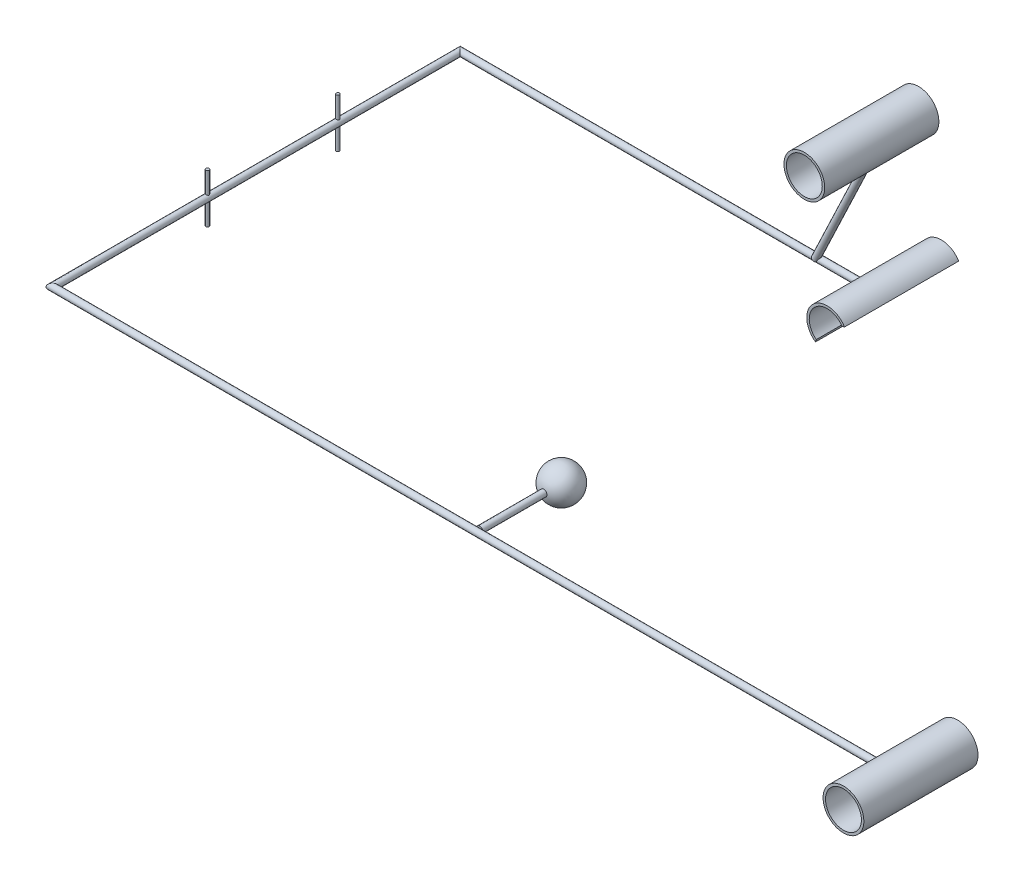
ISO-10303-21;
HEADER;
FILE_DESCRIPTION(('STEP AP214'),'2;1');
FILE_NAME('part.step','',(''),(''),'','','');
FILE_SCHEMA(('AUTOMOTIVE_DESIGN { 1 0 10303 214 1 1 1 1 }'));
ENDSEC;
DATA;
#1=APPLICATION_CONTEXT('core data for automotive mechanical design processes');
#2=APPLICATION_PROTOCOL_DEFINITION('international standard','automotive_design',2000,#1);
#3=PRODUCT_CONTEXT('',#1,'mechanical');
#4=PRODUCT('Part','Part','',(#3));
#5=PRODUCT_RELATED_PRODUCT_CATEGORY('part','',(#4));
#6=PRODUCT_DEFINITION_FORMATION('','',#4);
#7=PRODUCT_DEFINITION_CONTEXT('part definition',#1,'design');
#8=PRODUCT_DEFINITION('design','',#6,#7);
#9=PRODUCT_DEFINITION_SHAPE('','',#8);
#10=(LENGTH_UNIT() NAMED_UNIT(*) SI_UNIT(.MILLI.,.METRE.));
#11=(NAMED_UNIT(*) PLANE_ANGLE_UNIT() SI_UNIT($,.RADIAN.));
#12=(NAMED_UNIT(*) SI_UNIT($,.STERADIAN.) SOLID_ANGLE_UNIT());
#13=UNCERTAINTY_MEASURE_WITH_UNIT(LENGTH_MEASURE(1.E-05),#10,'distance_accuracy_value','');
#14=(GEOMETRIC_REPRESENTATION_CONTEXT(3) GLOBAL_UNCERTAINTY_ASSIGNED_CONTEXT((#13)) GLOBAL_UNIT_ASSIGNED_CONTEXT((#10,
#11,#12)) REPRESENTATION_CONTEXT('',''));
#15=CARTESIAN_POINT('',(0.,0.,0.));
#16=DIRECTION('',(0.,0.,1.));
#17=DIRECTION('',(1.,0.,0.));
#18=AXIS2_PLACEMENT_3D('',#15,#16,#17);
#19=CARTESIAN_POINT('',(-273.999999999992,74.5000000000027,-285.));
#20=DIRECTION('',(0.,0.,1.));
#21=DIRECTION('',(1.,0.,0.));
#22=AXIS2_PLACEMENT_3D('',#19,#20,#21);
#23=CYLINDRICAL_SURFACE('',#22,11.);
#24=CARTESIAN_POINT('',(-273.999999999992,74.5000000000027,-215.));
#25=DIRECTION('',(0.,0.,1.));
#26=DIRECTION('',(1.,0.,0.));
#27=AXIS2_PLACEMENT_3D('',#24,#25,#26);
#28=CIRCLE('',#27,11.);
#29=CARTESIAN_POINT('',(-262.999999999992,74.5000000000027,-215.));
#30=VERTEX_POINT('',#29);
#31=EDGE_CURVE('P0_E271',#30,#30,#28,.F.);
#32=ORIENTED_EDGE('',*,*,#31,.F.);
#33=EDGE_LOOP('',(#32));
#34=FACE_BOUND('',#33,.T.);
#35=CARTESIAN_POINT('',(-273.999999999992,74.5000000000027,-285.));
#36=DIRECTION('',(0.,0.,1.));
#37=DIRECTION('',(1.,0.,0.));
#38=AXIS2_PLACEMENT_3D('',#35,#36,#37);
#39=CIRCLE('',#38,11.);
#40=CARTESIAN_POINT('',(-262.999999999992,74.5000000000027,-285.));
#41=VERTEX_POINT('',#40);
#42=EDGE_CURVE('P0_E22',#41,#41,#39,.T.);
#43=ORIENTED_EDGE('',*,*,#42,.F.);
#44=EDGE_LOOP('',(#43));
#45=FACE_BOUND('',#44,.T.);
#46=ADVANCED_FACE('P0_F17',(#34,#45),#23,.F.);
#47=CARTESIAN_POINT('',(0.,0.,-35.));
#48=DIRECTION('',(0.,0.,1.));
#49=DIRECTION('',(1.,0.,0.));
#50=AXIS2_PLACEMENT_3D('',#47,#48,#49);
#51=CYLINDRICAL_SURFACE('',#50,11.);
#52=CARTESIAN_POINT('',(0.,0.,35.));
#53=DIRECTION('',(0.,0.,1.));
#54=DIRECTION('',(1.,0.,0.));
#55=AXIS2_PLACEMENT_3D('',#52,#53,#54);
#56=CIRCLE('',#55,11.);
#57=CARTESIAN_POINT('',(11.,0.,35.));
#58=VERTEX_POINT('',#57);
#59=EDGE_CURVE('P0_E103',#58,#58,#56,.F.);
#60=ORIENTED_EDGE('',*,*,#59,.F.);
#61=EDGE_LOOP('',(#60));
#62=FACE_BOUND('',#61,.T.);
#63=CARTESIAN_POINT('',(0.,0.,-35.));
#64=DIRECTION('',(0.,0.,1.));
#65=DIRECTION('',(1.,0.,0.));
#66=AXIS2_PLACEMENT_3D('',#63,#64,#65);
#67=CIRCLE('',#66,11.);
#68=CARTESIAN_POINT('',(11.,0.,-35.));
#69=VERTEX_POINT('',#68);
#70=EDGE_CURVE('P0_E269',#69,#69,#67,.T.);
#71=ORIENTED_EDGE('',*,*,#70,.F.);
#72=EDGE_LOOP('',(#71));
#73=FACE_BOUND('',#72,.T.);
#74=ADVANCED_FACE('P0_F282',(#62,#73),#51,.F.);
#75=CARTESIAN_POINT('',(-260.,0.,-285.));
#76=DIRECTION('',(0.,0.,1.));
#77=DIRECTION('',(1.,0.,0.));
#78=AXIS2_PLACEMENT_3D('',#75,#76,#77);
#79=CYLINDRICAL_SURFACE('',#78,11.);
#80=DIRECTION('',(0.,0.,1.));
#81=VECTOR('',#80,1.);
#82=CARTESIAN_POINT('',(-250.852339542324,6.10903496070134,-211.5));
#83=LINE('',#82,#81);
#84=CARTESIAN_POINT('',(-250.852339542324,6.10903496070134,-215.));
#85=VERTEX_POINT('',#84);
#86=CARTESIAN_POINT('',(-250.852339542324,6.10903496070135,-285.));
#87=VERTEX_POINT('',#86);
#88=EDGE_CURVE('P0_E72',#85,#87,#83,.F.);
#89=ORIENTED_EDGE('',*,*,#88,.F.);
#90=CARTESIAN_POINT('',(-260.,0.,-215.));
#91=DIRECTION('',(0.,0.,1.));
#92=DIRECTION('',(1.,0.,0.));
#93=AXIS2_PLACEMENT_3D('',#90,#91,#92);
#94=CIRCLE('',#93,11.);
#95=CARTESIAN_POINT('',(-266.642168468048,-8.76821521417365,-215.));
#96=VERTEX_POINT('',#95);
#97=EDGE_CURVE('P0_E75',#96,#85,#94,.F.);
#98=ORIENTED_EDGE('',*,*,#97,.F.);
#99=DIRECTION('',(0.,0.,1.));
#100=VECTOR('',#99,1.);
#101=CARTESIAN_POINT('',(-266.642168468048,-8.76821521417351,-211.5));
#102=LINE('',#101,#100);
#103=CARTESIAN_POINT('',(-266.642168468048,-8.76821521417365,-285.));
#104=VERTEX_POINT('',#103);
#105=EDGE_CURVE('P0_E67',#104,#96,#102,.T.);
#106=ORIENTED_EDGE('',*,*,#105,.F.);
#107=CARTESIAN_POINT('',(-260.,0.,-285.));
#108=DIRECTION('',(0.,0.,1.));
#109=DIRECTION('',(1.,0.,0.));
#110=AXIS2_PLACEMENT_3D('',#107,#108,#109);
#111=CIRCLE('',#110,11.);
#112=EDGE_CURVE('P0_E78',#87,#104,#111,.T.);
#113=ORIENTED_EDGE('',*,*,#112,.F.);
#114=EDGE_LOOP('',(#89,#98,#106,#113));
#115=FACE_BOUND('',#114,.T.);
#116=ADVANCED_FACE('P0_F74',(#115),#79,.F.);
#117=CARTESIAN_POINT('',(-260.249999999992,60.7500000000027,-285.));
#118=DIRECTION('',(0.,0.,-1.));
#119=DIRECTION('',(-1.,0.,0.));
#120=AXIS2_PLACEMENT_3D('',#117,#118,#119);
#121=PLANE('',#120);
#122=ORIENTED_EDGE('',*,*,#42,.T.);
#123=EDGE_LOOP('',(#122));
#124=FACE_BOUND('',#123,.T.);
#125=CARTESIAN_POINT('',(-273.999999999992,74.5000000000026,-285.));
#126=DIRECTION('',(0.,0.,1.));
#127=DIRECTION('',(0.,-1.,0.));
#128=AXIS2_PLACEMENT_3D('',#125,#126,#127);
#129=CIRCLE('',#128,12.5);
#130=CARTESIAN_POINT('',(-273.999999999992,62.0000000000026,-285.));
#131=VERTEX_POINT('',#130);
#132=EDGE_CURVE('P0_E261',#131,#131,#129,.T.);
#133=ORIENTED_EDGE('',*,*,#132,.F.);
#134=EDGE_LOOP('',(#133));
#135=FACE_BOUND('',#134,.T.);
#136=ADVANCED_FACE('P0_F278',(#124,#135),#121,.T.);
#137=CARTESIAN_POINT('',(-287.749999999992,60.7500000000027,-215.));
#138=DIRECTION('',(0.,0.,1.));
#139=DIRECTION('',(1.,0.,0.));
#140=AXIS2_PLACEMENT_3D('',#137,#138,#139);
#141=PLANE('',#140);
#142=ORIENTED_EDGE('',*,*,#31,.T.);
#143=EDGE_LOOP('',(#142));
#144=FACE_BOUND('',#143,.T.);
#145=CARTESIAN_POINT('',(-273.999999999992,74.5000000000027,-215.));
#146=DIRECTION('',(0.,0.,1.));
#147=DIRECTION('',(0.,-1.,0.));
#148=AXIS2_PLACEMENT_3D('',#145,#146,#147);
#149=CIRCLE('',#148,12.5);
#150=CARTESIAN_POINT('',(-273.999999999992,62.0000000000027,-215.));
#151=VERTEX_POINT('',#150);
#152=EDGE_CURVE('P0_E257',#151,#151,#149,.F.);
#153=ORIENTED_EDGE('',*,*,#152,.F.);
#154=EDGE_LOOP('',(#153));
#155=FACE_BOUND('',#154,.T.);
#156=ADVANCED_FACE('P0_F295',(#144,#155),#141,.T.);
#157=CARTESIAN_POINT('',(13.75,-13.75,-35.));
#158=DIRECTION('',(0.,0.,-1.));
#159=DIRECTION('',(-1.,0.,0.));
#160=AXIS2_PLACEMENT_3D('',#157,#158,#159);
#161=PLANE('',#160);
#162=ORIENTED_EDGE('',*,*,#70,.T.);
#163=EDGE_LOOP('',(#162));
#164=FACE_BOUND('',#163,.T.);
#165=CARTESIAN_POINT('',(0.,0.,-35.));
#166=DIRECTION('',(0.,0.,1.));
#167=DIRECTION('',(0.,-1.,0.));
#168=AXIS2_PLACEMENT_3D('',#165,#166,#167);
#169=CIRCLE('',#168,12.5);
#170=CARTESIAN_POINT('',(0.,-12.5,-35.));
#171=VERTEX_POINT('',#170);
#172=EDGE_CURVE('P0_E256',#171,#171,#169,.T.);
#173=ORIENTED_EDGE('',*,*,#172,.F.);
#174=EDGE_LOOP('',(#173));
#175=FACE_BOUND('',#174,.T.);
#176=ADVANCED_FACE('P0_F298',(#164,#175),#161,.T.);
#177=CARTESIAN_POINT('',(-13.75,-13.75,35.));
#178=DIRECTION('',(0.,0.,1.));
#179=DIRECTION('',(1.,0.,0.));
#180=AXIS2_PLACEMENT_3D('',#177,#178,#179);
#181=PLANE('',#180);
#182=ORIENTED_EDGE('',*,*,#59,.T.);
#183=EDGE_LOOP('',(#182));
#184=FACE_BOUND('',#183,.T.);
#185=CARTESIAN_POINT('',(0.,0.,35.));
#186=DIRECTION('',(0.,0.,1.));
#187=DIRECTION('',(0.,-1.,0.));
#188=AXIS2_PLACEMENT_3D('',#185,#186,#187);
#189=CIRCLE('',#188,12.5);
#190=CARTESIAN_POINT('',(0.,-12.5,35.));
#191=VERTEX_POINT('',#190);
#192=EDGE_CURVE('P0_E459',#191,#191,#189,.F.);
#193=ORIENTED_EDGE('',*,*,#192,.F.);
#194=EDGE_LOOP('',(#193));
#195=FACE_BOUND('',#194,.T.);
#196=ADVANCED_FACE('P0_F301',(#184,#195),#181,.T.);
#197=CARTESIAN_POINT('',(-267.144281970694,-10.3490454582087,-211.5));
#198=DIRECTION('',(0.953078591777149,-0.302722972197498,0.));
#199=DIRECTION('',(0.302722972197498,0.953078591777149,0.));
#200=AXIS2_PLACEMENT_3D('',#197,#198,#199);
#201=PLANE('',#200);
#202=DIRECTION('',(0.,0.,1.));
#203=VECTOR('',#202,1.);
#204=CARTESIAN_POINT('',(-267.120371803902,-10.2737678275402,-250.));
#205=LINE('',#204,#203);
#206=CARTESIAN_POINT('',(-267.120371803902,-10.2737678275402,-285.));
#207=VERTEX_POINT('',#206);
#208=CARTESIAN_POINT('',(-267.120371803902,-10.2737678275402,-215.));
#209=VERTEX_POINT('',#208);
#210=EDGE_CURVE('P0_E100',#207,#209,#205,.T.);
#211=ORIENTED_EDGE('',*,*,#210,.F.);
#212=DIRECTION('',(-0.302722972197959,-0.953078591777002,0.));
#213=VECTOR('',#212,1.);
#214=CARTESIAN_POINT('',(-266.642168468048,-8.76821521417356,-285.));
#215=LINE('',#214,#213);
#216=EDGE_CURVE('P0_E94',#104,#207,#215,.T.);
#217=ORIENTED_EDGE('',*,*,#216,.F.);
#218=ORIENTED_EDGE('',*,*,#105,.T.);
#219=DIRECTION('',(0.302722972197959,0.953078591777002,0.));
#220=VECTOR('',#219,1.);
#221=CARTESIAN_POINT('',(-267.120371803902,-10.2737678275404,-215.));
#222=LINE('',#221,#220);
#223=EDGE_CURVE('P0_E88',#209,#96,#222,.T.);
#224=ORIENTED_EDGE('',*,*,#223,.F.);
#225=EDGE_LOOP('',(#211,#217,#218,#224));
#226=FACE_BOUND('',#225,.T.);
#227=ADVANCED_FACE('P0_F305',(#226),#201,.T.);
#228=CARTESIAN_POINT('',(-273.645758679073,-11.4121145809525,-215.));
#229=DIRECTION('',(0.,0.,1.));
#230=DIRECTION('',(1.,0.,0.));
#231=AXIS2_PLACEMENT_3D('',#228,#229,#230);
#232=PLANE('',#231);
#233=DIRECTION('',(0.962225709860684,0.272252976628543,0.));
#234=VECTOR('',#233,1.);
#235=CARTESIAN_POINT('',(-250.927722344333,6.08770608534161,-215.));
#236=LINE('',#235,#234);
#237=CARTESIAN_POINT('',(-249.344683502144,6.53561246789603,-215.));
#238=VERTEX_POINT('',#237);
#239=EDGE_CURVE('P0_E82',#238,#85,#236,.F.);
#240=ORIENTED_EDGE('',*,*,#239,.F.);
#241=CARTESIAN_POINT('',(-260.,0.,-215.));
#242=DIRECTION('',(0.,0.,1.));
#243=DIRECTION('',(0.,-1.,0.));
#244=AXIS2_PLACEMENT_3D('',#241,#242,#243);
#245=CIRCLE('',#244,12.5);
#246=EDGE_CURVE('P0_E252',#209,#238,#245,.F.);
#247=ORIENTED_EDGE('',*,*,#246,.F.);
#248=ORIENTED_EDGE('',*,*,#223,.T.);
#249=ORIENTED_EDGE('',*,*,#97,.T.);
#250=EDGE_LOOP('',(#240,#247,#248,#249));
#251=FACE_BOUND('',#250,.T.);
#252=ADVANCED_FACE('P0_F85',(#251),#232,.T.);
#253=CARTESIAN_POINT('',(-250.927722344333,6.08770608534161,-211.5));
#254=DIRECTION('',(0.272252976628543,-0.962225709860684,0.));
#255=DIRECTION('',(0.962225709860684,0.272252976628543,0.));
#256=AXIS2_PLACEMENT_3D('',#253,#254,#255);
#257=PLANE('',#256);
#258=DIRECTION('',(0.,0.,-1.));
#259=VECTOR('',#258,1.);
#260=CARTESIAN_POINT('',(-249.344683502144,6.53561246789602,-250.));
#261=LINE('',#260,#259);
#262=CARTESIAN_POINT('',(-249.344683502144,6.53561246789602,-285.));
#263=VERTEX_POINT('',#262);
#264=EDGE_CURVE('P0_E92',#238,#263,#261,.T.);
#265=ORIENTED_EDGE('',*,*,#264,.F.);
#266=ORIENTED_EDGE('',*,*,#239,.T.);
#267=ORIENTED_EDGE('',*,*,#88,.T.);
#268=DIRECTION('',(-0.962225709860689,-0.272252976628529,0.));
#269=VECTOR('',#268,1.);
#270=CARTESIAN_POINT('',(-249.344683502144,6.53561246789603,-285.));
#271=LINE('',#270,#269);
#272=EDGE_CURVE('P0_E97',#263,#87,#271,.T.);
#273=ORIENTED_EDGE('',*,*,#272,.F.);
#274=EDGE_LOOP('',(#265,#266,#267,#273));
#275=FACE_BOUND('',#274,.T.);
#276=ADVANCED_FACE('P0_F90',(#275),#257,.T.);
#277=CARTESIAN_POINT('',(-248.1874894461,-11.4121145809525,-285.));
#278=DIRECTION('',(0.,0.,-1.));
#279=DIRECTION('',(-1.,0.,0.));
#280=AXIS2_PLACEMENT_3D('',#277,#278,#279);
#281=PLANE('',#280);
#282=ORIENTED_EDGE('',*,*,#272,.T.);
#283=ORIENTED_EDGE('',*,*,#112,.T.);
#284=ORIENTED_EDGE('',*,*,#216,.T.);
#285=CARTESIAN_POINT('',(-260.,-1.09555376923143E-13,-285.));
#286=DIRECTION('',(0.,0.,1.));
#287=DIRECTION('',(0.,-1.,0.));
#288=AXIS2_PLACEMENT_3D('',#285,#286,#287);
#289=CIRCLE('',#288,12.5);
#290=EDGE_CURVE('P0_E188',#263,#207,#289,.T.);
#291=ORIENTED_EDGE('',*,*,#290,.F.);
#292=EDGE_LOOP('',(#282,#283,#284,#291));
#293=FACE_BOUND('',#292,.T.);
#294=ADVANCED_FACE('P0_F197',(#293),#281,.T.);
#295=CARTESIAN_POINT('',(-273.999999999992,74.5000000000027,-215.));
#296=DIRECTION('',(0.,0.,1.));
#297=DIRECTION('',(0.,-1.,0.));
#298=AXIS2_PLACEMENT_3D('',#295,#296,#297);
#299=CYLINDRICAL_SURFACE('',#298,12.5);
#300=ORIENTED_EDGE('',*,*,#152,.T.);
#301=EDGE_LOOP('',(#300));
#302=FACE_BOUND('',#301,.T.);
#303=CARTESIAN_POINT('',(-271.69141542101,62.2150320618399,-247.165992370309));
#304=CARTESIAN_POINT('',(-271.774925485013,62.1993286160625,-247.165992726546));
#305=CARTESIAN_POINT('',(-271.8586312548,62.184490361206,-247.169536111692));
#306=CARTESIAN_POINT('',(-272.025834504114,62.1565887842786,-247.184046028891));
#307=CARTESIAN_POINT('',(-272.109331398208,62.1435284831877,-247.195025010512));
#308=CARTESIAN_POINT('',(-272.275596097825,62.1192273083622,-247.224810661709));
#309=CARTESIAN_POINT('',(-272.358359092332,62.1079946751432,-247.243651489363));
#310=CARTESIAN_POINT('',(-272.521781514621,62.0874396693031,-247.28942211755));
#311=CARTESIAN_POINT('',(-272.602442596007,62.078115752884,-247.316345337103));
#312=CARTESIAN_POINT('',(-272.79671972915,62.0575138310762,-247.392659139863));
#313=CARTESIAN_POINT('',(-272.908674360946,62.0472700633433,-247.446700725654));
#314=CARTESIAN_POINT('',(-273.122225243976,62.0303977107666,-247.572381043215));
#315=CARTESIAN_POINT('',(-273.223845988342,62.023760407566,-247.643976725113));
#316=CARTESIAN_POINT('',(-273.413700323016,62.0133927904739,-247.804580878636));
#317=CARTESIAN_POINT('',(-273.501842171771,62.009681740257,-247.893699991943));
#318=CARTESIAN_POINT('',(-273.659847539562,62.0043774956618,-248.087071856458));
#319=CARTESIAN_POINT('',(-273.72970944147,62.0027844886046,-248.191325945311));
#320=CARTESIAN_POINT('',(-273.841245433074,62.0008966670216,-248.399840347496));
#321=CARTESIAN_POINT('',(-273.885126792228,62.000481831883,-248.502921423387));
#322=CARTESIAN_POINT('',(-273.95347134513,62.0000391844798,-248.71531222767));
#323=CARTESIAN_POINT('',(-273.977946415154,62.0000111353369,-248.824618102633));
#324=CARTESIAN_POINT('',(-274.005404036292,61.9999943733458,-249.038080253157));
#325=CARTESIAN_POINT('',(-274.009772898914,62.000003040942,-249.142060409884));
#326=CARTESIAN_POINT('',(-274.000632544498,61.9999991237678,-249.349222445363));
#327=CARTESIAN_POINT('',(-273.987126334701,61.9999865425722,-249.452404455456));
#328=CARTESIAN_POINT('',(-273.94318325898,62.0001105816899,-249.653086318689));
#329=CARTESIAN_POINT('',(-273.913062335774,62.0002444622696,-249.750655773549));
#330=CARTESIAN_POINT('',(-273.837244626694,62.0010025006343,-249.939520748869));
#331=CARTESIAN_POINT('',(-273.791547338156,62.0016266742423,-250.030816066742));
#332=CARTESIAN_POINT('',(-273.684939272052,62.0038552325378,-250.207043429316));
#333=CARTESIAN_POINT('',(-273.623687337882,62.0054829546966,-250.291768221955));
#334=CARTESIAN_POINT('',(-273.488726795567,62.0102781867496,-250.450550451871));
#335=CARTESIAN_POINT('',(-273.415015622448,62.0134460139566,-250.524605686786));
#336=CARTESIAN_POINT('',(-273.252183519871,62.0221059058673,-250.665484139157));
#337=CARTESIAN_POINT('',(-273.162358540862,62.0277403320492,-250.731482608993));
#338=CARTESIAN_POINT('',(-272.974090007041,62.0418129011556,-250.849337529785));
#339=CARTESIAN_POINT('',(-272.875642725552,62.0502522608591,-250.901187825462));
#340=CARTESIAN_POINT('',(-272.661207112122,62.071383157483,-250.995822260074));
#341=CARTESIAN_POINT('',(-272.544501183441,62.0844510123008,-251.036887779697));
#342=CARTESIAN_POINT('',(-272.306941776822,62.1146097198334,-251.101956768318));
#343=CARTESIAN_POINT('',(-272.186087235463,62.1317016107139,-251.125955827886));
#344=CARTESIAN_POINT('',(-272.002472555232,62.1604757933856,-251.150022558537));
#345=CARTESIAN_POINT('',(-271.94019651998,62.1707175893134,-251.156053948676));
#346=CARTESIAN_POINT('',(-271.815725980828,62.1921598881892,-251.164031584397));
#347=CARTESIAN_POINT('',(-271.753531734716,62.2033576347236,-251.165989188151));
#348=CARTESIAN_POINT('',(-271.69141542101,62.2150320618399,-251.165992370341));
#349=B_SPLINE_CURVE_WITH_KNOTS('',3,(#303,#304,#305,#306,#307,#308,#309,#310,#311,#312,#313,
#314,#315,#316,#317,#318,#319,#320,#321,#322,#323,#324,#325,#326,#327,#328,#329,#330,#331,#332,
#333,#334,#335,#336,#337,#338,#339,#340,#341,#342,#343,#344,#345,#346,#347,#348),.UNSPECIFIED.,
.F.,.F.,(4,2,2,2,2,2,2,2,2,2,2,2,2,2,2,2,2,2,2,2,2,2,4),(0.,0.254890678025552,0.510209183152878,
0.766648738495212,1.02288005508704,1.39542408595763,1.76706346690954,2.14112940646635,
2.51522842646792,2.84955166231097,3.18367014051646,3.49436771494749,3.80501302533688,
4.10994520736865,4.4148872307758,4.7272030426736,5.03958322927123,5.37303406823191,
5.7066297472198,6.07843446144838,6.45033520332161,6.64041728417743,6.82996868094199),.UNSPECIFIED.);
#350=CARTESIAN_POINT('',(-271.69141542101,62.21503206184,-247.165992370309));
#351=VERTEX_POINT('',#350);
#352=CARTESIAN_POINT('',(-271.69141542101,62.2150320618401,-251.165992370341));
#353=VERTEX_POINT('',#352);
#354=EDGE_CURVE('P0_E179',#351,#353,#349,.T.);
#355=ORIENTED_EDGE('',*,*,#354,.F.);
#356=DIRECTION('',(0.,0.,1.));
#357=VECTOR('',#356,1.);
#358=CARTESIAN_POINT('',(-271.69141542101,62.2150320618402,-251.365992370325));
#359=LINE('',#358,#357);
#360=EDGE_CURVE('P0_E254',#353,#351,#359,.T.);
#361=ORIENTED_EDGE('',*,*,#360,.F.);
#362=EDGE_LOOP('',(#355,#361));
#363=FACE_BOUND('',#362,.T.);
#364=ORIENTED_EDGE('',*,*,#132,.T.);
#365=EDGE_LOOP('',(#364));
#366=FACE_BOUND('',#365,.T.);
#367=ADVANCED_FACE('P0_F191',(#302,#363,#366),#299,.T.);
#368=CARTESIAN_POINT('',(-271.781767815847,62.2578858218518,-251.365992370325));
#369=DIRECTION('',(0.428537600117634,0.903523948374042,0.));
#370=DIRECTION('',(-0.903523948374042,0.428537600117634,0.));
#371=AXIS2_PLACEMENT_3D('',#368,#369,#370);
#372=PLANE('',#371);
#373=ORIENTED_EDGE('',*,*,#360,.T.);
#374=CARTESIAN_POINT('',(-271.691415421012,62.2150320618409,-249.165992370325));
#375=DIRECTION('',(-0.428537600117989,-0.903523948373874,0.));
#376=DIRECTION('',(0.903523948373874,-0.428537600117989,0.));
#377=AXIS2_PLACEMENT_3D('',#374,#375,#376);
#378=CIRCLE('',#377,2.00000000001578);
#379=EDGE_CURVE('P0_E187',#353,#351,#378,.T.);
#380=ORIENTED_EDGE('',*,*,#379,.F.);
#381=EDGE_LOOP('',(#373,#380));
#382=FACE_BOUND('',#381,.T.);
#383=ADVANCED_FACE('P0_F196',(#382),#372,.T.);
#384=CARTESIAN_POINT('',(0.,0.,35.));
#385=DIRECTION('',(0.,0.,1.));
#386=DIRECTION('',(0.,-1.,0.));
#387=AXIS2_PLACEMENT_3D('',#384,#385,#386);
#388=CYLINDRICAL_SURFACE('',#387,12.5);
#389=ORIENTED_EDGE('',*,*,#192,.T.);
#390=EDGE_LOOP('',(#389));
#391=FACE_BOUND('',#390,.T.);
#392=CARTESIAN_POINT('',(-12.3389626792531,2.,0.));
#393=CARTESIAN_POINT('',(-12.3389646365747,1.99999546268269,-0.1115667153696));
#394=CARTESIAN_POINT('',(-12.3404922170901,1.99063305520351,-0.223195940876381));
#395=CARTESIAN_POINT('',(-12.3464325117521,1.95344445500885,-0.443326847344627));
#396=CARTESIAN_POINT('',(-12.3508479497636,1.92560083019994,-0.551825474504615));
#397=CARTESIAN_POINT('',(-12.3620513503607,1.85230972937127,-0.762477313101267));
#398=CARTESIAN_POINT('',(-12.3688373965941,1.8068764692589,-0.864635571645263));
#399=CARTESIAN_POINT('',(-12.3840151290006,1.6997304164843,-1.05986648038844));
#400=CARTESIAN_POINT('',(-12.3924066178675,1.63801962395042,-1.15294024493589));
#401=CARTESIAN_POINT('',(-12.409935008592,1.49947140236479,-1.32821893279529));
#402=CARTESIAN_POINT('',(-12.4190774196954,1.42251498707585,-1.41032926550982));
#403=CARTESIAN_POINT('',(-12.4370285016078,1.25591709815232,-1.56052945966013));
#404=CARTESIAN_POINT('',(-12.4458371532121,1.16627489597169,-1.62861851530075));
#405=CARTESIAN_POINT('',(-12.4621862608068,0.976239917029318,-1.7491959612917));
#406=CARTESIAN_POINT('',(-12.4697194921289,0.875790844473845,-1.80159669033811));
#407=CARTESIAN_POINT('',(-12.4826077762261,0.667375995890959,-1.88874693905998));
#408=CARTESIAN_POINT('',(-12.4879629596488,0.559410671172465,-1.92349751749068));
#409=CARTESIAN_POINT('',(-12.4958528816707,0.340004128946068,-1.97407274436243));
#410=CARTESIAN_POINT('',(-12.49841126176,0.228600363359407,-1.99005611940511));
#411=CARTESIAN_POINT('',(-12.500500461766,0.00466480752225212,-2.00313650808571));
#412=CARTESIAN_POINT('',(-12.5000314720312,-0.10786691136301,-2.00023470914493));
#413=CARTESIAN_POINT('',(-12.4961375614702,-0.329779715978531,-1.97575151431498));
#414=CARTESIAN_POINT('',(-12.4927396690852,-0.439180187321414,-1.95434091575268));
#415=CARTESIAN_POINT('',(-12.4833998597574,-0.652815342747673,-1.89371648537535));
#416=CARTESIAN_POINT('',(-12.4774578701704,-0.757049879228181,-1.85450214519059));
#417=CARTESIAN_POINT('',(-12.4636513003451,-0.957905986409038,-1.75921154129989));
#418=CARTESIAN_POINT('',(-12.4557786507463,-1.05449329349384,-1.70306427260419));
#419=CARTESIAN_POINT('',(-12.4389865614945,-1.23693967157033,-1.57555357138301));
#420=CARTESIAN_POINT('',(-12.4300670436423,-1.32279794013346,-1.50418900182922));
#421=CARTESIAN_POINT('',(-12.4120565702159,-1.48235721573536,-1.34732043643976));
#422=CARTESIAN_POINT('',(-12.4029648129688,-1.555911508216,-1.2616672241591));
#423=CARTESIAN_POINT('',(-12.3857313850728,-1.68762680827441,-1.07915724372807));
#424=CARTESIAN_POINT('',(-12.3775897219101,-1.74578769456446,-0.982300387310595));
#425=CARTESIAN_POINT('',(-12.3631781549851,-1.84509031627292,-0.779969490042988));
#426=CARTESIAN_POINT('',(-12.3569100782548,-1.88621545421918,-0.674487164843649));
#427=CARTESIAN_POINT('',(-12.3469864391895,-1.95012354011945,-0.457989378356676));
#428=CARTESIAN_POINT('',(-12.343330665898,-1.9729079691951,-0.346974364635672));
#429=CARTESIAN_POINT('',(-12.3390860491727,-1.99928349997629,-0.123872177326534));
#430=CARTESIAN_POINT('',(-12.338463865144,-2.0030832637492,-0.0118102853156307));
#431=CARTESIAN_POINT('',(-12.3402681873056,-1.99193667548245,0.211348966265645));
#432=CARTESIAN_POINT('',(-12.3426945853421,-1.97699098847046,0.322446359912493));
#433=CARTESIAN_POINT('',(-12.3502919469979,-1.92895527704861,0.539866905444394));
#434=CARTESIAN_POINT('',(-12.3554469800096,-1.89597053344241,0.646213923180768));
#435=CARTESIAN_POINT('',(-12.3679074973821,-1.81290306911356,0.85187038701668));
#436=CARTESIAN_POINT('',(-12.3752131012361,-1.76281939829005,0.951179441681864));
#437=CARTESIAN_POINT('',(-12.3912295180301,-1.64647965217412,1.14087239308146));
#438=CARTESIAN_POINT('',(-12.3999517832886,-1.58008930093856,1.23117295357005));
#439=CARTESIAN_POINT('',(-12.4177848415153,-1.43320604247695,1.39942606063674));
#440=CARTESIAN_POINT('',(-12.426895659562,-1.35271222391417,1.47737780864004));
#441=CARTESIAN_POINT('',(-12.4445842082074,-1.17898475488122,1.61947729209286));
#442=CARTESIAN_POINT('',(-12.4531560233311,-1.08563688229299,1.68348622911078));
#443=CARTESIAN_POINT('',(-12.4687070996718,-0.889391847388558,1.7949130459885));
#444=CARTESIAN_POINT('',(-12.4756864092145,-0.786494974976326,1.8423314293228));
#445=CARTESIAN_POINT('',(-12.4872402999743,-0.57449377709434,1.91901272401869));
#446=CARTESIAN_POINT('',(-12.491824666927,-0.46541676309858,1.94834960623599));
#447=CARTESIAN_POINT('',(-12.4981133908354,-0.243805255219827,1.98827383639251));
#448=CARTESIAN_POINT('',(-12.4998179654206,-0.131271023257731,1.99886260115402));
#449=CARTESIAN_POINT('',(-12.5001523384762,0.0927181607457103,2.00095179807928));
#450=CARTESIAN_POINT('',(-12.4988162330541,0.204171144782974,1.99266389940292));
#451=CARTESIAN_POINT('',(-12.4932886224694,0.424076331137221,1.95769116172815));
#452=CARTESIAN_POINT('',(-12.4890971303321,0.532528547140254,1.93100640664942));
#453=CARTESIAN_POINT('',(-12.4783277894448,0.743282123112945,1.86007617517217));
#454=CARTESIAN_POINT('',(-12.471752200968,0.845589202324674,1.81584732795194));
#455=CARTESIAN_POINT('',(-12.4569342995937,1.0413631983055,1.71110753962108));
#456=CARTESIAN_POINT('',(-12.4486919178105,1.13482974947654,1.65059592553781));
#457=CARTESIAN_POINT('',(-12.4313454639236,1.31133889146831,1.51425167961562));
#458=CARTESIAN_POINT('',(-12.4222331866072,1.39426053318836,1.4382634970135));
#459=CARTESIAN_POINT('',(-12.4042323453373,1.54625119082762,1.27345013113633));
#460=CARTESIAN_POINT('',(-12.3953438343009,1.61531695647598,1.18462194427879));
#461=CARTESIAN_POINT('',(-12.3787350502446,1.73804191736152,0.995970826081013));
#462=CARTESIAN_POINT('',(-12.3710226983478,1.79159866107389,0.896080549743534));
#463=CARTESIAN_POINT('',(-12.35773272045,1.88109182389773,0.68864171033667));
#464=CARTESIAN_POINT('',(-12.3521529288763,1.91704612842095,0.581101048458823));
#465=CARTESIAN_POINT('',(-12.3450187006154,1.96235985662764,0.394262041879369));
#466=CARTESIAN_POINT('',(-12.3427600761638,1.97645270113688,0.316104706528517));
#467=CARTESIAN_POINT('',(-12.339731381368,1.99527431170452,0.158642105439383));
#468=CARTESIAN_POINT('',(-12.3389612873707,2.00000322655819,0.0793368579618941));
#469=CARTESIAN_POINT('',(-12.3389626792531,2.,0.));
#470=B_SPLINE_CURVE_WITH_KNOTS('',3,(#392,#393,#394,#395,#396,#397,#398,#399,#400,#401,#402,
#403,#404,#405,#406,#407,#408,#409,#410,#411,#412,#413,#414,#415,#416,#417,#418,#419,#420,#421,
#422,#423,#424,#425,#426,#427,#428,#429,#430,#431,#432,#433,#434,#435,#436,#437,#438,#439,#440,
#441,#442,#443,#444,#445,#446,#447,#448,#449,#450,#451,#452,#453,#454,#455,#456,#457,#458,#459,
#460,#461,#462,#463,#464,#465,#466,#467,#468,#469),.UNSPECIFIED.,.T.,.F.,(4,2,2,2,2,2,2,2,2,2,2,
2,2,2,2,2,2,2,2,2,2,2,2,2,2,2,2,2,2,2,2,2,2,2,2,2,2,2,4),(0.,0.334410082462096,0.66913604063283,
1.00359203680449,1.33800695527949,1.6751426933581,2.01229780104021,2.35130309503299,
2.69028805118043,3.02638485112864,3.36246051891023,3.69546762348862,4.0284842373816,
4.3629171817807,4.69737512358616,5.03557384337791,5.37377522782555,5.71230534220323,
6.05080811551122,6.3855820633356,6.72034413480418,7.05317297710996,7.38602031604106,
7.7217061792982,8.05741374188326,8.39632425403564,8.73522448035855,9.07272891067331,
9.41020783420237,9.74392117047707,10.0776329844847,10.4110292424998,10.7444392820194,
11.0813822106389,11.4184040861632,11.7576040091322,12.0964585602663,12.3342666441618,
12.5720709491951),.UNSPECIFIED.);
#471=CARTESIAN_POINT('',(-12.3389626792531,2.,0.));
#472=VERTEX_POINT('',#471);
#473=EDGE_CURVE('P0_E210',#472,#472,#470,.T.);
#474=ORIENTED_EDGE('',*,*,#473,.F.);
#475=EDGE_LOOP('',(#474));
#476=FACE_BOUND('',#475,.T.);
#477=ORIENTED_EDGE('',*,*,#172,.T.);
#478=EDGE_LOOP('',(#477));
#479=FACE_BOUND('',#478,.T.);
#480=ADVANCED_FACE('P0_F202',(#391,#476,#479),#388,.T.);
#481=CARTESIAN_POINT('',(-521.1,-15.,-173.9));
#482=DIRECTION('',(0.,-1.,0.));
#483=DIRECTION('',(0.,0.,-1.));
#484=AXIS2_PLACEMENT_3D('',#481,#482,#483);
#485=PLANE('',#484);
#486=CARTESIAN_POINT('',(-520.,-15.,-175.));
#487=DIRECTION('',(0.,-1.,0.));
#488=DIRECTION('',(0.,0.,-1.));
#489=AXIS2_PLACEMENT_3D('',#486,#487,#488);
#490=CIRCLE('',#489,1.);
#491=CARTESIAN_POINT('',(-520.,-15.,-176.));
#492=VERTEX_POINT('',#491);
#493=EDGE_CURVE('P0_E215',#492,#492,#490,.F.);
#494=ORIENTED_EDGE('',*,*,#493,.F.);
#495=EDGE_LOOP('',(#494));
#496=FACE_BOUND('',#495,.T.);
#497=ADVANCED_FACE('P0_F207',(#496),#485,.T.);
#498=CARTESIAN_POINT('',(-521.1,-15.,-93.9));
#499=DIRECTION('',(0.,-1.,0.));
#500=DIRECTION('',(0.,0.,-1.));
#501=AXIS2_PLACEMENT_3D('',#498,#499,#500);
#502=PLANE('',#501);
#503=CARTESIAN_POINT('',(-520.,-15.,-95.));
#504=DIRECTION('',(0.,-1.,0.));
#505=DIRECTION('',(0.,0.,-1.));
#506=AXIS2_PLACEMENT_3D('',#503,#504,#505);
#507=CIRCLE('',#506,1.);
#508=CARTESIAN_POINT('',(-520.,-15.,-96.));
#509=VERTEX_POINT('',#508);
#510=EDGE_CURVE('P0_E411',#509,#509,#507,.F.);
#511=ORIENTED_EDGE('',*,*,#510,.F.);
#512=EDGE_LOOP('',(#511));
#513=FACE_BOUND('',#512,.T.);
#514=ADVANCED_FACE('P0_F337',(#513),#502,.T.);
#515=CARTESIAN_POINT('',(-521.1,15.,-96.1));
#516=DIRECTION('',(0.,1.,0.));
#517=DIRECTION('',(0.,0.,1.));
#518=AXIS2_PLACEMENT_3D('',#515,#516,#517);
#519=PLANE('',#518);
#520=CARTESIAN_POINT('',(-520.,15.,-95.));
#521=DIRECTION('',(0.,-1.,0.));
#522=DIRECTION('',(0.,0.,-1.));
#523=AXIS2_PLACEMENT_3D('',#520,#521,#522);
#524=CIRCLE('',#523,1.);
#525=CARTESIAN_POINT('',(-520.,15.,-96.));
#526=VERTEX_POINT('',#525);
#527=EDGE_CURVE('P0_E161',#526,#526,#524,.T.);
#528=ORIENTED_EDGE('',*,*,#527,.F.);
#529=EDGE_LOOP('',(#528));
#530=FACE_BOUND('',#529,.T.);
#531=ADVANCED_FACE('P0_F168',(#530),#519,.T.);
#532=CARTESIAN_POINT('',(-260.,0.,-215.));
#533=DIRECTION('',(0.,0.,1.));
#534=DIRECTION('',(0.,-1.,0.));
#535=AXIS2_PLACEMENT_3D('',#532,#533,#534);
#536=CYLINDRICAL_SURFACE('',#535,12.5);
#537=CARTESIAN_POINT('',(-272.338962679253,-2.,-250.));
#538=CARTESIAN_POINT('',(-272.338964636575,-1.99999546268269,-249.88843328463));
#539=CARTESIAN_POINT('',(-272.34049221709,-1.99063305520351,-249.776804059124));
#540=CARTESIAN_POINT('',(-272.346432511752,-1.95344445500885,-249.556673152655));
#541=CARTESIAN_POINT('',(-272.350847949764,-1.92560083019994,-249.448174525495));
#542=CARTESIAN_POINT('',(-272.362051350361,-1.85230972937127,-249.237522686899));
#543=CARTESIAN_POINT('',(-272.368837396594,-1.8068764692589,-249.135364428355));
#544=CARTESIAN_POINT('',(-272.384015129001,-1.69973041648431,-248.940133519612));
#545=CARTESIAN_POINT('',(-272.392406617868,-1.63801962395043,-248.847059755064));
#546=CARTESIAN_POINT('',(-272.409935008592,-1.49947140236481,-248.671781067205));
#547=CARTESIAN_POINT('',(-272.419077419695,-1.42251498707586,-248.58967073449));
#548=CARTESIAN_POINT('',(-272.437028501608,-1.25591709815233,-248.43947054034));
#549=CARTESIAN_POINT('',(-272.445837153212,-1.16627489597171,-248.371381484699));
#550=CARTESIAN_POINT('',(-272.462186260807,-0.97623991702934,-248.250804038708));
#551=CARTESIAN_POINT('',(-272.469719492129,-0.875790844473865,-248.198403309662));
#552=CARTESIAN_POINT('',(-272.482607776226,-0.667375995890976,-248.11125306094));
#553=CARTESIAN_POINT('',(-272.487962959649,-0.55941067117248,-248.076502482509));
#554=CARTESIAN_POINT('',(-272.495852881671,-0.340004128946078,-248.025927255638));
#555=CARTESIAN_POINT('',(-272.49841126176,-0.228600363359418,-248.009943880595));
#556=CARTESIAN_POINT('',(-272.500500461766,-0.00466480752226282,-247.996863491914));
#557=CARTESIAN_POINT('',(-272.500031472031,0.107866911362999,-247.999765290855));
#558=CARTESIAN_POINT('',(-272.49613756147,0.329779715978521,-248.024248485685));
#559=CARTESIAN_POINT('',(-272.492739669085,0.439180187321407,-248.045659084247));
#560=CARTESIAN_POINT('',(-272.483399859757,0.652815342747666,-248.106283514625));
#561=CARTESIAN_POINT('',(-272.47745787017,0.757049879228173,-248.145497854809));
#562=CARTESIAN_POINT('',(-272.463651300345,0.957905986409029,-248.2407884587));
#563=CARTESIAN_POINT('',(-272.455778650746,1.05449329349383,-248.296935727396));
#564=CARTESIAN_POINT('',(-272.438986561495,1.23693967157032,-248.424446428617));
#565=CARTESIAN_POINT('',(-272.430067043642,1.32279794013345,-248.495810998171));
#566=CARTESIAN_POINT('',(-272.412056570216,1.48235721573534,-248.65267956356));
#567=CARTESIAN_POINT('',(-272.402964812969,1.55591150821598,-248.738332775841));
#568=CARTESIAN_POINT('',(-272.385731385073,1.68762680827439,-248.920842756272));
#569=CARTESIAN_POINT('',(-272.37758972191,1.74578769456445,-249.017699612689));
#570=CARTESIAN_POINT('',(-272.363178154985,1.84509031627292,-249.220030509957));
#571=CARTESIAN_POINT('',(-272.356910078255,1.88621545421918,-249.325512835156));
#572=CARTESIAN_POINT('',(-272.346986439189,1.95012354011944,-249.542010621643));
#573=CARTESIAN_POINT('',(-272.343330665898,1.9729079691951,-249.653025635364));
#574=CARTESIAN_POINT('',(-272.339086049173,1.99928349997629,-249.876127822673));
#575=CARTESIAN_POINT('',(-272.338463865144,2.0030832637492,-249.988189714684));
#576=CARTESIAN_POINT('',(-272.340268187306,1.99193667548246,-250.211348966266));
#577=CARTESIAN_POINT('',(-272.342694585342,1.97699098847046,-250.322446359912));
#578=CARTESIAN_POINT('',(-272.350291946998,1.92895527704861,-250.539866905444));
#579=CARTESIAN_POINT('',(-272.35544698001,1.89597053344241,-250.646213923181));
#580=CARTESIAN_POINT('',(-272.367907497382,1.81290306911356,-250.851870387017));
#581=CARTESIAN_POINT('',(-272.375213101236,1.76281939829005,-250.951179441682));
#582=CARTESIAN_POINT('',(-272.39122951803,1.64647965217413,-251.140872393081));
#583=CARTESIAN_POINT('',(-272.399951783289,1.58008930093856,-251.23117295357));
#584=CARTESIAN_POINT('',(-272.417784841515,1.43320604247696,-251.399426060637));
#585=CARTESIAN_POINT('',(-272.426895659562,1.35271222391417,-251.47737780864));
#586=CARTESIAN_POINT('',(-272.444584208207,1.17898475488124,-251.619477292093));
#587=CARTESIAN_POINT('',(-272.453156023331,1.08563688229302,-251.683486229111));
#588=CARTESIAN_POINT('',(-272.468707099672,0.889391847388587,-251.794913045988));
#589=CARTESIAN_POINT('',(-272.475686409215,0.786494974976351,-251.842331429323));
#590=CARTESIAN_POINT('',(-272.487240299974,0.574493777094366,-251.919012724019));
#591=CARTESIAN_POINT('',(-272.491824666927,0.465416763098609,-251.948349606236));
#592=CARTESIAN_POINT('',(-272.498113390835,0.243805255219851,-251.988273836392));
#593=CARTESIAN_POINT('',(-272.499817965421,0.131271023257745,-251.998862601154));
#594=CARTESIAN_POINT('',(-272.500152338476,-0.0927181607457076,-252.000951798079));
#595=CARTESIAN_POINT('',(-272.498816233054,-0.204171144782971,-251.992663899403));
#596=CARTESIAN_POINT('',(-272.493288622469,-0.424076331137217,-251.957691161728));
#597=CARTESIAN_POINT('',(-272.489097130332,-0.532528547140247,-251.931006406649));
#598=CARTESIAN_POINT('',(-272.478327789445,-0.74328212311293,-251.860076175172));
#599=CARTESIAN_POINT('',(-272.471752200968,-0.845589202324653,-251.815847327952));
#600=CARTESIAN_POINT('',(-272.456934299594,-1.04136319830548,-251.711107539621));
#601=CARTESIAN_POINT('',(-272.44869191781,-1.13482974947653,-251.650595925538));
#602=CARTESIAN_POINT('',(-272.431345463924,-1.3113388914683,-251.514251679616));
#603=CARTESIAN_POINT('',(-272.422233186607,-1.39426053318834,-251.438263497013));
#604=CARTESIAN_POINT('',(-272.404232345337,-1.5462511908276,-251.273450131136));
#605=CARTESIAN_POINT('',(-272.395343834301,-1.61531695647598,-251.184621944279));
#606=CARTESIAN_POINT('',(-272.378735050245,-1.73804191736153,-250.995970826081));
#607=CARTESIAN_POINT('',(-272.371022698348,-1.7915986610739,-250.896080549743));
#608=CARTESIAN_POINT('',(-272.35773272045,-1.88109182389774,-250.688641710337));
#609=CARTESIAN_POINT('',(-272.352152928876,-1.91704612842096,-250.581101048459));
#610=CARTESIAN_POINT('',(-272.345018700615,-1.96235985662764,-250.394262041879));
#611=CARTESIAN_POINT('',(-272.342760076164,-1.97645270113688,-250.316104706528));
#612=CARTESIAN_POINT('',(-272.339731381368,-1.99527431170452,-250.158642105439));
#613=CARTESIAN_POINT('',(-272.338961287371,-2.00000322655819,-250.079336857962));
#614=CARTESIAN_POINT('',(-272.338962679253,-2.,-250.));
#615=B_SPLINE_CURVE_WITH_KNOTS('',3,(#537,#538,#539,#540,#541,#542,#543,#544,#545,#546,#547,
#548,#549,#550,#551,#552,#553,#554,#555,#556,#557,#558,#559,#560,#561,#562,#563,#564,#565,#566,
#567,#568,#569,#570,#571,#572,#573,#574,#575,#576,#577,#578,#579,#580,#581,#582,#583,#584,#585,
#586,#587,#588,#589,#590,#591,#592,#593,#594,#595,#596,#597,#598,#599,#600,#601,#602,#603,#604,
#605,#606,#607,#608,#609,#610,#611,#612,#613,#614),.UNSPECIFIED.,.T.,.F.,(4,2,2,2,2,2,2,2,2,2,2,
2,2,2,2,2,2,2,2,2,2,2,2,2,2,2,2,2,2,2,2,2,2,2,2,2,2,2,4),(0.,0.334410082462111,
0.669136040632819,1.0035920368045,1.33800695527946,1.67514269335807,2.01229780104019,
2.35130309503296,2.69028805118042,3.02638485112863,3.36246051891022,3.69546762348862,
4.02848423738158,4.3629171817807,4.69737512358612,5.03557384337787,5.37377522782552,
5.7123053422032,6.05080811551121,6.38558206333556,6.72034413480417,7.05317297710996,
7.38602031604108,7.72170617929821,8.05741374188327,8.39632425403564,8.73522448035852,
9.07272891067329,9.41020783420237,9.74392117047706,10.0776329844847,10.4110292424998,
10.7444392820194,11.0813822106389,11.4184040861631,11.7576040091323,12.0964585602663,
12.3342666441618,12.5720709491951),.UNSPECIFIED.);
#616=CARTESIAN_POINT('',(-272.338962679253,-2.,-250.));
#617=VERTEX_POINT('',#616);
#618=EDGE_CURVE('P0_E155',#617,#617,#615,.T.);
#619=ORIENTED_EDGE('',*,*,#618,.F.);
#620=EDGE_LOOP('',(#619));
#621=FACE_BOUND('',#620,.T.);
#622=ORIENTED_EDGE('',*,*,#264,.T.);
#623=ORIENTED_EDGE('',*,*,#290,.T.);
#624=ORIENTED_EDGE('',*,*,#210,.T.);
#625=ORIENTED_EDGE('',*,*,#246,.T.);
#626=EDGE_LOOP('',(#622,#623,#624,#625));
#627=FACE_BOUND('',#626,.T.);
#628=ADVANCED_FACE('P0_F163',(#621,#627),#536,.T.);
#629=CARTESIAN_POINT('',(-301.199742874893,1.20129600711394E-11,-249.165992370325));
#630=DIRECTION('',(-0.428537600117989,-0.903523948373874,0.));
#631=DIRECTION('',(0.903523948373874,-0.428537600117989,0.));
#632=AXIS2_PLACEMENT_3D('',#629,#630,#631);
#633=CYLINDRICAL_SURFACE('',#632,2.00000000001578);
#634=ORIENTED_EDGE('',*,*,#354,.T.);
#635=ORIENTED_EDGE('',*,*,#379,.T.);
#636=EDGE_LOOP('',(#634,#635));
#637=FACE_BOUND('',#636,.T.);
#638=CARTESIAN_POINT('',(-302.751035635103,0.735771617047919,-248.14025804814));
#639=CARTESIAN_POINT('',(-302.740116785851,0.787053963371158,-248.160532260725));
#640=CARTESIAN_POINT('',(-302.730439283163,0.837695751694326,-248.183034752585));
#641=CARTESIAN_POINT('',(-302.713023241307,0.937171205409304,-248.23229687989));
#642=CARTESIAN_POINT('',(-302.705283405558,0.986006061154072,-248.259053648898));
#643=CARTESIAN_POINT('',(-302.69119463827,1.0813509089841,-248.316616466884));
#644=CARTESIAN_POINT('',(-302.684843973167,1.12786374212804,-248.347417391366));
#645=CARTESIAN_POINT('',(-302.672934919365,1.21821423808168,-248.412842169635));
#646=CARTESIAN_POINT('',(-302.667376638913,1.26205153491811,-248.447466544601));
#647=CARTESIAN_POINT('',(-302.65102656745,1.38891225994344,-248.556626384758));
#648=CARTESIAN_POINT('',(-302.64053944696,1.46745020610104,-248.63654871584));
#649=CARTESIAN_POINT('',(-302.616184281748,1.60983732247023,-248.808005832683));
#650=CARTESIAN_POINT('',(-302.602317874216,1.6736935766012,-248.899534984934));
#651=CARTESIAN_POINT('',(-302.567648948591,1.78512275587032,-249.091338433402));
#652=CARTESIAN_POINT('',(-302.54682201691,1.83263715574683,-249.19164258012));
#653=CARTESIAN_POINT('',(-302.495596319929,1.90993404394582,-249.39656394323));
#654=CARTESIAN_POINT('',(-302.465199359,1.93971987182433,-249.501180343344));
#655=CARTESIAN_POINT('',(-302.395562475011,1.98035402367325,-249.703163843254));
#656=CARTESIAN_POINT('',(-302.357036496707,1.99232002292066,-249.800554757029));
#657=CARTESIAN_POINT('',(-302.269582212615,2.00225886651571,-249.991263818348));
#658=CARTESIAN_POINT('',(-302.220654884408,2.00023302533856,-250.084582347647));
#659=CARTESIAN_POINT('',(-302.112405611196,1.98458042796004,-250.263644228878));
#660=CARTESIAN_POINT('',(-302.053103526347,1.97097564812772,-250.349401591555));
#661=CARTESIAN_POINT('',(-301.924187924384,1.93541567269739,-250.510893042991));
#662=CARTESIAN_POINT('',(-301.854567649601,1.91345498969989,-250.586620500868));
#663=CARTESIAN_POINT('',(-301.700290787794,1.86345739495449,-250.730557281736));
#664=CARTESIAN_POINT('',(-301.614936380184,1.83511035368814,-250.797913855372));
#665=CARTESIAN_POINT('',(-301.433597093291,1.77883658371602,-250.916550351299));
#666=CARTESIAN_POINT('',(-301.3376189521,1.75090960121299,-250.967840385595));
#667=CARTESIAN_POINT('',(-301.137666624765,1.70136994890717,-251.052497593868));
#668=CARTESIAN_POINT('',(-301.033781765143,1.67969706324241,-251.086038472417));
#669=CARTESIAN_POINT('',(-300.820437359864,1.64656417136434,-251.135669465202));
#670=CARTESIAN_POINT('',(-300.710981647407,1.63509724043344,-251.151771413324));
#671=CARTESIAN_POINT('',(-300.499974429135,1.62412037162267,-251.16717343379));
#672=CARTESIAN_POINT('',(-300.398556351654,1.62366361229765,-251.167804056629));
#673=CARTESIAN_POINT('',(-300.196584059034,1.63120089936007,-251.157245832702));
#674=CARTESIAN_POINT('',(-300.096031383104,1.63920773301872,-251.146039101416));
#675=CARTESIAN_POINT('',(-299.919965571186,1.65912247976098,-251.116933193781));
#676=CARTESIAN_POINT('',(-299.843936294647,1.66973722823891,-251.101122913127));
#677=CARTESIAN_POINT('',(-299.693745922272,1.69382839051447,-251.063692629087));
#678=CARTESIAN_POINT('',(-299.619585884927,1.70730638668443,-251.042069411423));
#679=CARTESIAN_POINT('',(-299.473389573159,1.73619060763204,-250.993201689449));
#680=CARTESIAN_POINT('',(-299.401357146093,1.75160008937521,-250.965947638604));
#681=CARTESIAN_POINT('',(-299.25992278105,1.78340832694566,-250.905873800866));
#682=CARTESIAN_POINT('',(-299.190519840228,1.79980669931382,-250.873056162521));
#683=CARTESIAN_POINT('',(-299.016784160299,1.84190457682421,-250.781765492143));
#684=CARTESIAN_POINT('',(-298.91457751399,1.8676866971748,-250.719196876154));
#685=CARTESIAN_POINT('',(-298.720312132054,1.91578531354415,-250.579009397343));
#686=CARTESIAN_POINT('',(-298.628222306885,1.93811251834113,-250.501438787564));
#687=CARTESIAN_POINT('',(-298.489180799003,1.96805001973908,-250.360474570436));
#688=CARTESIAN_POINT('',(-298.437861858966,1.97806805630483,-250.301926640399));
#689=CARTESIAN_POINT('',(-298.343414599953,1.99304570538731,-250.177922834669));
#690=CARTESIAN_POINT('',(-298.300275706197,1.99801188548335,-250.112476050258));
#691=CARTESIAN_POINT('',(-298.231510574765,2.00075229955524,-249.987711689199));
#692=CARTESIAN_POINT('',(-298.204131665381,1.99965508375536,-249.929394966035));
#693=CARTESIAN_POINT('',(-298.158090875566,1.99183119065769,-249.809765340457));
#694=CARTESIAN_POINT('',(-298.139420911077,1.98510975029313,-249.74845527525));
#695=CARTESIAN_POINT('',(-298.111740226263,1.9654143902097,-249.62436130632));
#696=CARTESIAN_POINT('',(-298.102771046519,1.95241392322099,-249.561572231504));
#697=CARTESIAN_POINT('',(-298.094743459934,1.92019123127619,-249.436964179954));
#698=CARTESIAN_POINT('',(-298.095688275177,1.90096698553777,-249.375145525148));
#699=CARTESIAN_POINT('',(-298.106266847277,1.85826398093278,-249.258034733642));
#700=CARTESIAN_POINT('',(-298.115377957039,1.83510814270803,-249.202573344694));
#701=CARTESIAN_POINT('',(-298.140334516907,1.78462663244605,-249.095216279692));
#702=CARTESIAN_POINT('',(-298.156182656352,1.75729929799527,-249.043322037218));
#703=CARTESIAN_POINT('',(-298.20419229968,1.68214344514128,-248.914282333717));
#704=CARTESIAN_POINT('',(-298.240468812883,1.6316976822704,-248.840198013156));
#705=CARTESIAN_POINT('',(-298.322069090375,1.52438502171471,-248.702335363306));
#706=CARTESIAN_POINT('',(-298.367418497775,1.46750012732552,-248.638587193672));
#707=CARTESIAN_POINT('',(-298.452428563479,1.36265037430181,-248.534641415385));
#708=CARTESIAN_POINT('',(-298.490936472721,1.31571388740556,-248.492423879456));
#709=CARTESIAN_POINT('',(-298.57012019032,1.21918694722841,-248.413343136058));
#710=CARTESIAN_POINT('',(-298.610797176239,1.16959505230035,-248.37648287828));
#711=CARTESIAN_POINT('',(-298.693436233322,1.067813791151,-248.307796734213));
#712=CARTESIAN_POINT('',(-298.735401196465,1.01561838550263,-248.275983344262));
#713=CARTESIAN_POINT('',(-298.819675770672,0.908761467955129,-248.217342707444));
#714=CARTESIAN_POINT('',(-298.861985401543,0.854099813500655,-248.190515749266));
#715=CARTESIAN_POINT('',(-298.947901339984,0.739903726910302,-248.140811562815));
#716=CARTESIAN_POINT('',(-298.991487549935,0.680261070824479,-248.118147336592));
#717=CARTESIAN_POINT('',(-299.077213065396,0.558112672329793,-248.078376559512));
#718=CARTESIAN_POINT('',(-299.119352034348,0.495606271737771,-248.061271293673));
#719=CARTESIAN_POINT('',(-299.200992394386,0.367919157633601,-248.033050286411));
#720=CARTESIAN_POINT('',(-299.240503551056,0.302749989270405,-248.021911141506));
#721=CARTESIAN_POINT('',(-299.315966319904,0.169671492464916,-248.006084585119));
#722=CARTESIAN_POINT('',(-299.351920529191,0.101764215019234,-248.001392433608));
#723=CARTESIAN_POINT('',(-299.430866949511,-0.0603027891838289,-247.998752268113));
#724=CARTESIAN_POINT('',(-299.472016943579,-0.155447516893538,-248.003684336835));
#725=CARTESIAN_POINT('',(-299.54419419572,-0.347629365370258,-248.028077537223));
#726=CARTESIAN_POINT('',(-299.575238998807,-0.444662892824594,-248.047513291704));
#727=CARTESIAN_POINT('',(-299.610305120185,-0.573575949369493,-248.083705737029));
#728=CARTESIAN_POINT('',(-299.618659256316,-0.606281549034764,-248.093798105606));
#729=CARTESIAN_POINT('',(-299.634315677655,-0.67132474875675,-248.115724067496));
#730=CARTESIAN_POINT('',(-299.641618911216,-0.703662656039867,-248.127556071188));
#731=CARTESIAN_POINT('',(-299.648450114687,-0.735771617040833,-248.140258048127));
#732=B_SPLINE_CURVE_WITH_KNOTS('',3,(#638,#639,#640,#641,#642,#643,#644,#645,#646,#647,#648,
#649,#650,#651,#652,#653,#654,#655,#656,#657,#658,#659,#660,#661,#662,#663,#664,#665,#666,#667,
#668,#669,#670,#671,#672,#673,#674,#675,#676,#677,#678,#679,#680,#681,#682,#683,#684,#685,#686,
#687,#688,#689,#690,#691,#692,#693,#694,#695,#696,#697,#698,#699,#700,#701,#702,#703,#704,#705,
#706,#707,#708,#709,#710,#711,#712,#713,#714,#715,#716,#717,#718,#719,#720,#721,#722,#723,#724,
#725,#726,#727,#728,#729,#730,#731),.UNSPECIFIED.,.F.,.F.,(4,2,2,2,2,2,2,2,2,2,2,2,2,2,2,2,2,2,
2,2,2,2,2,2,2,2,2,2,2,2,2,2,2,2,2,2,2,2,2,2,2,2,2,2,2,2,4),(0.,0.168553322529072,
0.336993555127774,0.505222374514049,0.673474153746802,1.00940101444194,1.34516544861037,
1.68212013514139,2.01901132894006,2.33372275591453,2.64840461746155,2.96249055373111,
3.27678311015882,3.61229470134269,3.94759470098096,4.27954953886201,4.6112789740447,
4.91436901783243,5.21791764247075,5.45276083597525,5.68773415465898,5.92310916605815,
6.15839348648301,6.5250070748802,6.89046051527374,7.1252648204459,7.35976348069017,
7.5522733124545,7.74460409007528,7.9377552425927,8.13096917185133,8.31263615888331,
8.494375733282,8.7828089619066,9.07206922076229,9.29362835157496,9.51530901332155,
9.73753027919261,9.95976440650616,10.1913248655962,10.4229388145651,10.6536374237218,
10.8841663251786,11.1941092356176,11.5035111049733,11.609162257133,11.7147174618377),.UNSPECIFIED.);
#733=CARTESIAN_POINT('',(-302.751035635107,0.735771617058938,-248.140258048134));
#734=VERTEX_POINT('',#733);
#735=CARTESIAN_POINT('',(-299.648450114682,-0.735771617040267,-248.140258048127));
#736=VERTEX_POINT('',#735);
#737=EDGE_CURVE('P0_E148',#734,#736,#732,.T.);
#738=ORIENTED_EDGE('',*,*,#737,.F.);
#739=CARTESIAN_POINT('',(-301.199742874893,1.2015535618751E-11,-249.165992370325));
#740=DIRECTION('',(-0.428537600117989,-0.903523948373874,0.));
#741=DIRECTION('',(0.903523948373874,-0.428537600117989,0.));
#742=AXIS2_PLACEMENT_3D('',#739,#740,#741);
#743=CIRCLE('',#742,2.00000000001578);
#744=EDGE_CURVE('P0_E36',#736,#734,#743,.T.);
#745=ORIENTED_EDGE('',*,*,#744,.F.);
#746=EDGE_LOOP('',(#738,#745));
#747=FACE_BOUND('',#746,.T.);
#748=ADVANCED_FACE('P0_F167',(#637,#747),#633,.T.);
#749=CARTESIAN_POINT('',(-302.906164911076,0.809348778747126,-247.117279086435));
#750=DIRECTION('',(-0.428537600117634,-0.903523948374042,0.));
#751=DIRECTION('',(0.903523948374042,-0.428537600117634,0.));
#752=AXIS2_PLACEMENT_3D('',#749,#750,#751);
#753=PLANE('',#752);
#754=CARTESIAN_POINT('',(-301.199742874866,0.,-250.));
#755=DIRECTION('',(-0.428537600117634,-0.903523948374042,0.));
#756=DIRECTION('',(-0.903523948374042,0.428537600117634,0.));
#757=AXIS2_PLACEMENT_3D('',#754,#755,#756);
#758=ELLIPSE('',#757,4.66703505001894,2.);
#759=EDGE_CURVE('P0_E397',#736,#734,#758,.T.);
#760=ORIENTED_EDGE('',*,*,#759,.F.);
#761=ORIENTED_EDGE('',*,*,#744,.T.);
#762=EDGE_LOOP('',(#760,#761));
#763=FACE_BOUND('',#762,.T.);
#764=ADVANCED_FACE('P0_F174',(#763),#753,.T.);
#765=CARTESIAN_POINT('',(-9.28099643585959,0.,0.));
#766=DIRECTION('',(1.,0.,0.));
#767=DIRECTION('',(0.,0.,-1.));
#768=AXIS2_PLACEMENT_3D('',#765,#766,#767);
#769=CYLINDRICAL_SURFACE('',#768,2.);
#770=ORIENTED_EDGE('',*,*,#473,.T.);
#771=EDGE_LOOP('',(#770));
#772=FACE_BOUND('',#771,.T.);
#773=CARTESIAN_POINT('',(-520.,0.,0.));
#774=DIRECTION('',(0.707106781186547,0.,0.707106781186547));
#775=DIRECTION('',(-0.707106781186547,0.,0.707106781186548));
#776=AXIS2_PLACEMENT_3D('',#773,#774,#775);
#777=ELLIPSE('',#776,2.82842712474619,2.);
#778=CARTESIAN_POINT('',(-522.,0.,2.));
#779=VERTEX_POINT('',#778);
#780=EDGE_CURVE('P0_E398',#779,#779,#777,.F.);
#781=ORIENTED_EDGE('',*,*,#780,.F.);
#782=EDGE_LOOP('',(#781));
#783=FACE_BOUND('',#782,.T.);
#784=ADVANCED_FACE('P0_F216',(#772,#783),#769,.T.);
#785=CARTESIAN_POINT('',(-520.,-15.,-175.));
#786=DIRECTION('',(0.,-1.,0.));
#787=DIRECTION('',(0.,0.,-1.));
#788=AXIS2_PLACEMENT_3D('',#785,#786,#787);
#789=CYLINDRICAL_SURFACE('',#788,1.);
#790=CARTESIAN_POINT('',(-519.,-1.73205080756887,-175.));
#791=CARTESIAN_POINT('',(-519.000003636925,-1.73205534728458,-175.052107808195));
#792=CARTESIAN_POINT('',(-519.004100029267,-1.73443801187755,-175.104281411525));
#793=CARTESIAN_POINT('',(-519.020276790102,-1.74362366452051,-175.207027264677));
#794=CARTESIAN_POINT('',(-519.032373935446,-1.75043594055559,-175.257595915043));
#795=CARTESIAN_POINT('',(-519.0639000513,-1.76749346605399,-175.355451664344));
#796=CARTESIAN_POINT('',(-519.083290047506,-1.77772043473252,-175.402754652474));
#797=CARTESIAN_POINT('',(-519.128732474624,-1.80042664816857,-175.493424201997));
#798=CARTESIAN_POINT('',(-519.154785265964,-1.81290601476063,-175.536790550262));
#799=CARTESIAN_POINT('',(-519.215333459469,-1.83996869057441,-175.622305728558));
#800=CARTESIAN_POINT('',(-519.250347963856,-1.85464063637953,-175.664059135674));
#801=CARTESIAN_POINT('',(-519.326746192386,-1.88371982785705,-175.741408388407));
#802=CARTESIAN_POINT('',(-519.368133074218,-1.89812693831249,-175.777001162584));
#803=CARTESIAN_POINT('',(-519.459510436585,-1.92621476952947,-175.843367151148));
#804=CARTESIAN_POINT('',(-519.509892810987,-1.93978106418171,-175.87365376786));
#805=CARTESIAN_POINT('',(-519.615842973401,-1.96350756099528,-175.925140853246));
#806=CARTESIAN_POINT('',(-519.671407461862,-1.97366991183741,-175.946347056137));
#807=CARTESIAN_POINT('',(-519.781955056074,-1.98880461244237,-175.977504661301));
#808=CARTESIAN_POINT('',(-519.836698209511,-1.99409480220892,-175.988149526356));
#809=CARTESIAN_POINT('',(-519.947429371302,-2.00007583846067,-176.000166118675));
#810=CARTESIAN_POINT('',(-520.003416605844,-2.00076946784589,-176.001543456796));
#811=CARTESIAN_POINT('',(-520.109832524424,-1.99762981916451,-175.99525332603));
#812=CARTESIAN_POINT('',(-520.160321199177,-1.99418495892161,-175.988361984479));
#813=CARTESIAN_POINT('',(-520.259313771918,-1.98374245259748,-175.967119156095));
#814=CARTESIAN_POINT('',(-520.307817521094,-1.97674454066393,-175.952767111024));
#815=CARTESIAN_POINT('',(-520.40230939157,-1.95971583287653,-175.91691743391));
#816=CARTESIAN_POINT('',(-520.448253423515,-1.94964441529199,-175.895323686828));
#817=CARTESIAN_POINT('',(-520.535976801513,-1.92737645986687,-175.845736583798));
#818=CARTESIAN_POINT('',(-520.577754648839,-1.91517916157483,-175.817740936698));
#819=CARTESIAN_POINT('',(-520.660173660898,-1.88844394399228,-175.753104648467));
#820=CARTESIAN_POINT('',(-520.700334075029,-1.87379375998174,-175.715896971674));
#821=CARTESIAN_POINT('',(-520.774104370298,-1.84454340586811,-175.63541027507));
#822=CARTESIAN_POINT('',(-520.807709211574,-1.82994328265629,-175.592126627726));
#823=CARTESIAN_POINT('',(-520.869505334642,-1.80144156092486,-175.497351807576));
#824=CARTESIAN_POINT('',(-520.897217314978,-1.7876431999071,-175.445513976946));
#825=CARTESIAN_POINT('',(-520.943319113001,-1.76375450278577,-175.337062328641));
#826=CARTESIAN_POINT('',(-520.961718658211,-1.75366030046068,-175.280453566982));
#827=CARTESIAN_POINT('',(-520.987180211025,-1.73944635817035,-175.168785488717));
#828=CARTESIAN_POINT('',(-520.99502512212,-1.73491655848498,-175.113958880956));
#829=CARTESIAN_POINT('',(-521.001516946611,-1.7311791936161,-175.003598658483));
#830=CARTESIAN_POINT('',(-521.000170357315,-1.73196786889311,-174.94806557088));
#831=CARTESIAN_POINT('',(-520.989036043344,-1.73834336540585,-174.844346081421));
#832=CARTESIAN_POINT('',(-520.980187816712,-1.74339587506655,-174.796020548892));
#833=CARTESIAN_POINT('',(-520.955696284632,-1.75694021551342,-174.701632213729));
#834=CARTESIAN_POINT('',(-520.940050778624,-1.76543316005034,-174.655570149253));
#835=CARTESIAN_POINT('',(-520.901647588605,-1.78536222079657,-174.564588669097));
#836=CARTESIAN_POINT('',(-520.878594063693,-1.79691643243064,-174.519820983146));
#837=CARTESIAN_POINT('',(-520.826287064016,-1.82156119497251,-174.434530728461));
#838=CARTESIAN_POINT('',(-520.797030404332,-1.83465253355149,-174.394010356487));
#839=CARTESIAN_POINT('',(-520.728837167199,-1.86287998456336,-174.313021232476));
#840=CARTESIAN_POINT('',(-520.689145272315,-1.87806583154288,-174.273202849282));
#841=CARTESIAN_POINT('',(-520.603404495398,-1.90734234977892,-174.200587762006));
#842=CARTESIAN_POINT('',(-520.557353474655,-1.9214326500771,-174.167793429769));
#843=CARTESIAN_POINT('',(-520.458535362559,-1.94741361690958,-174.10942627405));
#844=CARTESIAN_POINT('',(-520.405623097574,-1.9592364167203,-174.084066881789));
#845=CARTESIAN_POINT('',(-520.295522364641,-1.97883354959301,-174.042862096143));
#846=CARTESIAN_POINT('',(-520.238337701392,-1.98661143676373,-174.027008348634));
#847=CARTESIAN_POINT('',(-520.12697968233,-1.99667508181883,-174.006631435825));
#848=CARTESIAN_POINT('',(-520.07301144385,-1.99939927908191,-174.001202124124));
#849=CARTESIAN_POINT('',(-519.964874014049,-2.00042130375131,-173.999156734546));
#850=CARTESIAN_POINT('',(-519.910704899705,-1.9987206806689,-174.002537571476));
#851=CARTESIAN_POINT('',(-519.807462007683,-1.99133968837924,-174.017416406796));
#852=CARTESIAN_POINT('',(-519.758287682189,-1.98592894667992,-174.028364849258));
#853=CARTESIAN_POINT('',(-519.662554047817,-1.97192093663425,-174.057326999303));
#854=CARTESIAN_POINT('',(-519.615995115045,-1.96332321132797,-174.075341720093));
#855=CARTESIAN_POINT('',(-519.524576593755,-1.9432593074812,-174.118727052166));
#856=CARTESIAN_POINT('',(-519.4798748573,-1.93168617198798,-174.144379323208));
#857=CARTESIAN_POINT('',(-519.395225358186,-1.90688133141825,-174.201957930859));
#858=CARTESIAN_POINT('',(-519.355279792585,-1.89364886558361,-174.233887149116));
#859=CARTESIAN_POINT('',(-519.277085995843,-1.86528610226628,-174.306797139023));
#860=CARTESIAN_POINT('',(-519.239402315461,-1.85009799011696,-174.348362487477));
#861=CARTESIAN_POINT('',(-519.171336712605,-1.8206307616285,-174.43745072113));
#862=CARTESIAN_POINT('',(-519.14096124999,-1.80635245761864,-174.484978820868));
#863=CARTESIAN_POINT('',(-519.087568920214,-1.77999605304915,-174.586636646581));
#864=CARTESIAN_POINT('',(-519.064814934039,-1.76800174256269,-174.640927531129));
#865=CARTESIAN_POINT('',(-519.029121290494,-1.74866156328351,-174.75333240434));
#866=CARTESIAN_POINT('',(-519.016148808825,-1.74130016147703,-174.811432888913));
#867=CARTESIAN_POINT('',(-519.005632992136,-1.7352927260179,-174.891805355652));
#868=CARTESIAN_POINT('',(-519.003523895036,-1.73408129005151,-174.913367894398));
#869=CARTESIAN_POINT('',(-519.00070659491,-1.73245935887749,-174.956616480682));
#870=CARTESIAN_POINT('',(-518.9999984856,-1.73204891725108,-174.978302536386));
#871=CARTESIAN_POINT('',(-519.,-1.73205080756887,-175.));
#872=B_SPLINE_CURVE_WITH_KNOTS('',3,(#790,#791,#792,#793,#794,#795,#796,#797,#798,#799,#800,
#801,#802,#803,#804,#805,#806,#807,#808,#809,#810,#811,#812,#813,#814,#815,#816,#817,#818,#819,
#820,#821,#822,#823,#824,#825,#826,#827,#828,#829,#830,#831,#832,#833,#834,#835,#836,#837,#838,
#839,#840,#841,#842,#843,#844,#845,#846,#847,#848,#849,#850,#851,#852,#853,#854,#855,#856,#857,
#858,#859,#860,#861,#862,#863,#864,#865,#866,#867,#868,#869,#870,#871),.UNSPECIFIED.,.T.,.F.,(4,
2,2,2,2,2,2,2,2,2,2,2,2,2,2,2,2,2,2,2,2,2,2,2,2,2,2,2,2,2,2,2,2,2,2,2,2,2,2,2,4),(0.,
0.156232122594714,0.312792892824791,0.468528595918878,0.624272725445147,0.792862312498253,
0.961535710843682,1.14157892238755,1.32150826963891,1.48863484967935,1.65566023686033,
1.80816097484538,1.96067312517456,2.11529534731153,2.2699729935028,2.43927191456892,
2.60870048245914,2.78888841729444,2.968887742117,3.13462290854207,3.30024093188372,
3.44774183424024,3.59529052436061,3.74967296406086,3.90413486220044,4.07806743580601,
4.25205864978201,4.43064181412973,4.60906779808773,4.77112270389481,4.93312086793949,
5.08444424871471,5.23578933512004,5.39360750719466,5.55149830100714,5.7251024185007,
5.89885942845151,6.07810749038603,6.25675133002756,6.32180135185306,6.3868557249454),.UNSPECIFIED.);
#873=CARTESIAN_POINT('',(-519.,-1.73205080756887,-175.));
#874=VERTEX_POINT('',#873);
#875=EDGE_CURVE('P0_E118',#874,#874,#872,.T.);
#876=ORIENTED_EDGE('',*,*,#875,.F.);
#877=EDGE_LOOP('',(#876));
#878=FACE_BOUND('',#877,.T.);
#879=ORIENTED_EDGE('',*,*,#493,.T.);
#880=EDGE_LOOP('',(#879));
#881=FACE_BOUND('',#880,.T.);
#882=ADVANCED_FACE('P0_F219',(#878,#881),#789,.T.);
#883=CARTESIAN_POINT('',(-520.,-15.,-95.));
#884=DIRECTION('',(0.,-1.,0.));
#885=DIRECTION('',(0.,0.,-1.));
#886=AXIS2_PLACEMENT_3D('',#883,#884,#885);
#887=CYLINDRICAL_SURFACE('',#886,1.);
#888=CARTESIAN_POINT('',(-519.,-1.73205080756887,-95.));
#889=CARTESIAN_POINT('',(-519.000003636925,-1.73205534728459,-95.0521078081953));
#890=CARTESIAN_POINT('',(-519.004100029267,-1.73443801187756,-95.1042814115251));
#891=CARTESIAN_POINT('',(-519.020276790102,-1.74362366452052,-95.2070272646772));
#892=CARTESIAN_POINT('',(-519.032373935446,-1.75043594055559,-95.2575959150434));
#893=CARTESIAN_POINT('',(-519.0639000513,-1.76749346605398,-95.3554516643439));
#894=CARTESIAN_POINT('',(-519.083290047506,-1.77772043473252,-95.4027546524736));
#895=CARTESIAN_POINT('',(-519.128732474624,-1.80042664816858,-95.4934242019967));
#896=CARTESIAN_POINT('',(-519.154785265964,-1.81290601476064,-95.5367905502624));
#897=CARTESIAN_POINT('',(-519.215333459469,-1.83996869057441,-95.6223057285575));
#898=CARTESIAN_POINT('',(-519.250347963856,-1.85464063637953,-95.6640591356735));
#899=CARTESIAN_POINT('',(-519.326746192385,-1.88371982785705,-95.7414083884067));
#900=CARTESIAN_POINT('',(-519.368133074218,-1.89812693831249,-95.7770011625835));
#901=CARTESIAN_POINT('',(-519.459510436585,-1.92621476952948,-95.8433671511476));
#902=CARTESIAN_POINT('',(-519.509892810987,-1.93978106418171,-95.8736537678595));
#903=CARTESIAN_POINT('',(-519.615842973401,-1.96350756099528,-95.9251408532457));
#904=CARTESIAN_POINT('',(-519.671407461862,-1.97366991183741,-95.9463470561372));
#905=CARTESIAN_POINT('',(-519.781955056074,-1.98880461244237,-95.9775046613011));
#906=CARTESIAN_POINT('',(-519.836698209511,-1.99409480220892,-95.9881495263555));
#907=CARTESIAN_POINT('',(-519.947429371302,-2.00007583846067,-96.000166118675));
#908=CARTESIAN_POINT('',(-520.003416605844,-2.0007694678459,-96.0015434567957));
#909=CARTESIAN_POINT('',(-520.109832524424,-1.99762981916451,-95.9952533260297));
#910=CARTESIAN_POINT('',(-520.160321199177,-1.99418495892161,-95.9883619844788));
#911=CARTESIAN_POINT('',(-520.259313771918,-1.98374245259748,-95.9671191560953));
#912=CARTESIAN_POINT('',(-520.307817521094,-1.97674454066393,-95.9527671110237));
#913=CARTESIAN_POINT('',(-520.40230939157,-1.95971583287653,-95.9169174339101));
#914=CARTESIAN_POINT('',(-520.448253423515,-1.94964441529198,-95.8953236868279));
#915=CARTESIAN_POINT('',(-520.535976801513,-1.92737645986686,-95.8457365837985));
#916=CARTESIAN_POINT('',(-520.577754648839,-1.91517916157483,-95.8177409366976));
#917=CARTESIAN_POINT('',(-520.660173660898,-1.88844394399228,-95.7531046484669));
#918=CARTESIAN_POINT('',(-520.700334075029,-1.87379375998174,-95.7158969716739));
#919=CARTESIAN_POINT('',(-520.774104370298,-1.84454340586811,-95.6354102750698));
#920=CARTESIAN_POINT('',(-520.807709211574,-1.82994328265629,-95.5921266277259));
#921=CARTESIAN_POINT('',(-520.869505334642,-1.80144156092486,-95.4973518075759));
#922=CARTESIAN_POINT('',(-520.897217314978,-1.78764319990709,-95.4455139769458));
#923=CARTESIAN_POINT('',(-520.943319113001,-1.76375450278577,-95.337062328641));
#924=CARTESIAN_POINT('',(-520.961718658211,-1.75366030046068,-95.2804535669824));
#925=CARTESIAN_POINT('',(-520.987180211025,-1.73944635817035,-95.1687854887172));
#926=CARTESIAN_POINT('',(-520.99502512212,-1.73491655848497,-95.1139588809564));
#927=CARTESIAN_POINT('',(-521.001516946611,-1.7311791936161,-95.0035986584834));
#928=CARTESIAN_POINT('',(-521.000170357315,-1.73196786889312,-94.9480655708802));
#929=CARTESIAN_POINT('',(-520.989036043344,-1.73834336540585,-94.8443460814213));
#930=CARTESIAN_POINT('',(-520.980187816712,-1.74339587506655,-94.7960205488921));
#931=CARTESIAN_POINT('',(-520.955696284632,-1.75694021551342,-94.701632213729));
#932=CARTESIAN_POINT('',(-520.940050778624,-1.76543316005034,-94.6555701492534));
#933=CARTESIAN_POINT('',(-520.901647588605,-1.78536222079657,-94.5645886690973));
#934=CARTESIAN_POINT('',(-520.878594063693,-1.79691643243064,-94.5198209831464));
#935=CARTESIAN_POINT('',(-520.826287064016,-1.82156119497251,-94.434530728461));
#936=CARTESIAN_POINT('',(-520.797030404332,-1.83465253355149,-94.3940103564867));
#937=CARTESIAN_POINT('',(-520.728837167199,-1.86287998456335,-94.3130212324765));
#938=CARTESIAN_POINT('',(-520.689145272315,-1.87806583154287,-94.2732028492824));
#939=CARTESIAN_POINT('',(-520.603404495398,-1.90734234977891,-94.2005877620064));
#940=CARTESIAN_POINT('',(-520.557353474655,-1.92143265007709,-94.1677934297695));
#941=CARTESIAN_POINT('',(-520.458535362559,-1.94741361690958,-94.1094262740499));
#942=CARTESIAN_POINT('',(-520.405623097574,-1.9592364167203,-94.0840668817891));
#943=CARTESIAN_POINT('',(-520.295522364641,-1.97883354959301,-94.0428620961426));
#944=CARTESIAN_POINT('',(-520.238337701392,-1.98661143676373,-94.0270083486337));
#945=CARTESIAN_POINT('',(-520.12697968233,-1.99667508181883,-94.0066314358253));
#946=CARTESIAN_POINT('',(-520.07301144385,-1.99939927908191,-94.0012021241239));
#947=CARTESIAN_POINT('',(-519.964874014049,-2.00042130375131,-93.9991567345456));
#948=CARTESIAN_POINT('',(-519.910704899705,-1.9987206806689,-94.0025375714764));
#949=CARTESIAN_POINT('',(-519.807462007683,-1.99133968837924,-94.0174164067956));
#950=CARTESIAN_POINT('',(-519.758287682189,-1.98592894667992,-94.0283648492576));
#951=CARTESIAN_POINT('',(-519.662554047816,-1.97192093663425,-94.0573269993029));
#952=CARTESIAN_POINT('',(-519.615995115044,-1.96332321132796,-94.0753417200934));
#953=CARTESIAN_POINT('',(-519.524576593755,-1.94325930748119,-94.118727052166));
#954=CARTESIAN_POINT('',(-519.4798748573,-1.93168617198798,-94.1443793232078));
#955=CARTESIAN_POINT('',(-519.395225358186,-1.90688133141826,-94.2019579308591));
#956=CARTESIAN_POINT('',(-519.355279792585,-1.89364886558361,-94.2338871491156));
#957=CARTESIAN_POINT('',(-519.277085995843,-1.86528610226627,-94.3067971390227));
#958=CARTESIAN_POINT('',(-519.239402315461,-1.85009799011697,-94.3483624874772));
#959=CARTESIAN_POINT('',(-519.171336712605,-1.82063076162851,-94.4374507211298));
#960=CARTESIAN_POINT('',(-519.14096124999,-1.80635245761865,-94.4849788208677));
#961=CARTESIAN_POINT('',(-519.087568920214,-1.77999605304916,-94.5866366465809));
#962=CARTESIAN_POINT('',(-519.064814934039,-1.7680017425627,-94.6409275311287));
#963=CARTESIAN_POINT('',(-519.029121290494,-1.74866156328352,-94.7533324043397));
#964=CARTESIAN_POINT('',(-519.016148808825,-1.74130016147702,-94.8114328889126));
#965=CARTESIAN_POINT('',(-519.005632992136,-1.7352927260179,-94.891805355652));
#966=CARTESIAN_POINT('',(-519.003523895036,-1.73408129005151,-94.9133678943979));
#967=CARTESIAN_POINT('',(-519.00070659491,-1.73245935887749,-94.9566164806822));
#968=CARTESIAN_POINT('',(-518.9999984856,-1.73204891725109,-94.9783025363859));
#969=CARTESIAN_POINT('',(-519.,-1.73205080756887,-95.));
#970=B_SPLINE_CURVE_WITH_KNOTS('',3,(#888,#889,#890,#891,#892,#893,#894,#895,#896,#897,#898,
#899,#900,#901,#902,#903,#904,#905,#906,#907,#908,#909,#910,#911,#912,#913,#914,#915,#916,#917,
#918,#919,#920,#921,#922,#923,#924,#925,#926,#927,#928,#929,#930,#931,#932,#933,#934,#935,#936,
#937,#938,#939,#940,#941,#942,#943,#944,#945,#946,#947,#948,#949,#950,#951,#952,#953,#954,#955,
#956,#957,#958,#959,#960,#961,#962,#963,#964,#965,#966,#967,#968,#969),.UNSPECIFIED.,.T.,.F.,(4,
2,2,2,2,2,2,2,2,2,2,2,2,2,2,2,2,2,2,2,2,2,2,2,2,2,2,2,2,2,2,2,2,2,2,2,2,2,2,2,4),(0.,
0.156232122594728,0.31279289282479,0.468528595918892,0.624272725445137,0.792862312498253,
0.961535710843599,1.14157892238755,1.32150826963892,1.48863484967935,1.65566023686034,
1.80816097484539,1.96067312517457,2.11529534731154,2.26997299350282,2.43927191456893,
2.60870048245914,2.78888841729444,2.96888774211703,3.1346229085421,3.30024093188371,
3.44774183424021,3.59529052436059,3.74967296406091,3.90413486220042,4.07806743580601,
4.252058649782,4.43064181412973,4.60906779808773,4.77112270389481,4.93312086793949,
5.08444424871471,5.23578933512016,5.39360750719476,5.55149830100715,5.7251024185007,
5.89885942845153,6.078107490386,6.25675133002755,6.32180135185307,6.38685572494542),.UNSPECIFIED.);
#971=CARTESIAN_POINT('',(-519.,-1.73205080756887,-95.));
#972=VERTEX_POINT('',#971);
#973=EDGE_CURVE('P0_E132',#972,#972,#970,.T.);
#974=ORIENTED_EDGE('',*,*,#973,.F.);
#975=EDGE_LOOP('',(#974));
#976=FACE_BOUND('',#975,.T.);
#977=ORIENTED_EDGE('',*,*,#510,.T.);
#978=EDGE_LOOP('',(#977));
#979=FACE_BOUND('',#978,.T.);
#980=ADVANCED_FACE('P0_F140',(#976,#979),#887,.T.);
#981=CARTESIAN_POINT('',(-520.,1.65244311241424,-95.));
#982=DIRECTION('',(0.,-1.,0.));
#983=DIRECTION('',(0.,0.,-1.));
#984=AXIS2_PLACEMENT_3D('',#981,#982,#983);
#985=CYLINDRICAL_SURFACE('',#984,1.);
#986=CARTESIAN_POINT('',(-519.,1.73205080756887,-95.));
#987=CARTESIAN_POINT('',(-519.000003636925,1.73205534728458,-94.9478921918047));
#988=CARTESIAN_POINT('',(-519.004100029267,1.73443801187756,-94.8957185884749));
#989=CARTESIAN_POINT('',(-519.020276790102,1.74362366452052,-94.7929727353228));
#990=CARTESIAN_POINT('',(-519.032373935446,1.75043594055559,-94.7424040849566));
#991=CARTESIAN_POINT('',(-519.0639000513,1.76749346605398,-94.6445483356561));
#992=CARTESIAN_POINT('',(-519.083290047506,1.77772043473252,-94.5972453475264));
#993=CARTESIAN_POINT('',(-519.128732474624,1.80042664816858,-94.5065757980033));
#994=CARTESIAN_POINT('',(-519.154785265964,1.81290601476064,-94.4632094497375));
#995=CARTESIAN_POINT('',(-519.215333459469,1.83996869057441,-94.3776942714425));
#996=CARTESIAN_POINT('',(-519.250347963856,1.85464063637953,-94.3359408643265));
#997=CARTESIAN_POINT('',(-519.326746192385,1.88371982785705,-94.2585916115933));
#998=CARTESIAN_POINT('',(-519.368133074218,1.89812693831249,-94.2229988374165));
#999=CARTESIAN_POINT('',(-519.459510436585,1.92621476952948,-94.1566328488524));
#1000=CARTESIAN_POINT('',(-519.509892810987,1.93978106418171,-94.1263462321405));
#1001=CARTESIAN_POINT('',(-519.615842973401,1.96350756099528,-94.0748591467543));
#1002=CARTESIAN_POINT('',(-519.671407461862,1.97366991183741,-94.0536529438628));
#1003=CARTESIAN_POINT('',(-519.781955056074,1.98880461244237,-94.0224953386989));
#1004=CARTESIAN_POINT('',(-519.836698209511,1.99409480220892,-94.0118504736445));
#1005=CARTESIAN_POINT('',(-519.947429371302,2.00007583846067,-93.999833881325));
#1006=CARTESIAN_POINT('',(-520.003416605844,2.0007694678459,-93.9984565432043));
#1007=CARTESIAN_POINT('',(-520.109832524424,1.9976298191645,-94.0047466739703));
#1008=CARTESIAN_POINT('',(-520.160321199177,1.99418495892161,-94.0116380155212));
#1009=CARTESIAN_POINT('',(-520.259313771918,1.98374245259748,-94.0328808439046));
#1010=CARTESIAN_POINT('',(-520.307817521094,1.97674454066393,-94.0472328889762));
#1011=CARTESIAN_POINT('',(-520.40230939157,1.95971583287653,-94.0830825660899));
#1012=CARTESIAN_POINT('',(-520.448253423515,1.94964441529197,-94.1046763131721));
#1013=CARTESIAN_POINT('',(-520.535976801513,1.92737645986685,-94.1542634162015));
#1014=CARTESIAN_POINT('',(-520.577754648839,1.91517916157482,-94.1822590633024));
#1015=CARTESIAN_POINT('',(-520.660173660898,1.88844394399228,-94.2468953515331));
#1016=CARTESIAN_POINT('',(-520.700334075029,1.87379375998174,-94.2841030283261));
#1017=CARTESIAN_POINT('',(-520.774104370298,1.84454340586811,-94.3645897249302));
#1018=CARTESIAN_POINT('',(-520.807709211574,1.82994328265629,-94.4078733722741));
#1019=CARTESIAN_POINT('',(-520.869505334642,1.80144156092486,-94.5026481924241));
#1020=CARTESIAN_POINT('',(-520.897217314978,1.78764319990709,-94.5544860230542));
#1021=CARTESIAN_POINT('',(-520.943319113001,1.76375450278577,-94.662937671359));
#1022=CARTESIAN_POINT('',(-520.961718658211,1.75366030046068,-94.7195464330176));
#1023=CARTESIAN_POINT('',(-520.987180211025,1.73944635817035,-94.8312145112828));
#1024=CARTESIAN_POINT('',(-520.99502512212,1.73491655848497,-94.8860411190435));
#1025=CARTESIAN_POINT('',(-521.001516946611,1.7311791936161,-94.9964013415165));
#1026=CARTESIAN_POINT('',(-521.000170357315,1.73196786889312,-95.0519344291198));
#1027=CARTESIAN_POINT('',(-520.989036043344,1.73834336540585,-95.1556539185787));
#1028=CARTESIAN_POINT('',(-520.980187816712,1.74339587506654,-95.2039794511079));
#1029=CARTESIAN_POINT('',(-520.955696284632,1.75694021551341,-95.2983677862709));
#1030=CARTESIAN_POINT('',(-520.940050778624,1.76543316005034,-95.3444298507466));
#1031=CARTESIAN_POINT('',(-520.901647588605,1.78536222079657,-95.4354113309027));
#1032=CARTESIAN_POINT('',(-520.878594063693,1.79691643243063,-95.4801790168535));
#1033=CARTESIAN_POINT('',(-520.826287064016,1.8215611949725,-95.565469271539));
#1034=CARTESIAN_POINT('',(-520.797030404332,1.83465253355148,-95.6059896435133));
#1035=CARTESIAN_POINT('',(-520.728837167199,1.86287998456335,-95.6869787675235));
#1036=CARTESIAN_POINT('',(-520.689145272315,1.87806583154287,-95.7267971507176));
#1037=CARTESIAN_POINT('',(-520.603404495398,1.90734234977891,-95.7994122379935));
#1038=CARTESIAN_POINT('',(-520.557353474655,1.92143265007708,-95.8322065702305));
#1039=CARTESIAN_POINT('',(-520.458535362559,1.94741361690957,-95.8905737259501));
#1040=CARTESIAN_POINT('',(-520.405623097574,1.9592364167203,-95.9159331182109));
#1041=CARTESIAN_POINT('',(-520.295522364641,1.97883354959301,-95.9571379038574));
#1042=CARTESIAN_POINT('',(-520.238337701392,1.98661143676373,-95.9729916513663));
#1043=CARTESIAN_POINT('',(-520.12697968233,1.99667508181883,-95.9933685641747));
#1044=CARTESIAN_POINT('',(-520.07301144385,1.99939927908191,-95.9987978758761));
#1045=CARTESIAN_POINT('',(-519.964874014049,2.00042130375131,-96.0008432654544));
#1046=CARTESIAN_POINT('',(-519.910704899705,1.9987206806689,-95.9974624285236));
#1047=CARTESIAN_POINT('',(-519.807462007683,1.99133968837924,-95.9825835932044));
#1048=CARTESIAN_POINT('',(-519.758287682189,1.98592894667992,-95.9716351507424));
#1049=CARTESIAN_POINT('',(-519.662554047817,1.97192093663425,-95.9426730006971));
#1050=CARTESIAN_POINT('',(-519.615995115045,1.96332321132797,-95.9246582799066));
#1051=CARTESIAN_POINT('',(-519.524576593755,1.94325930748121,-95.881272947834));
#1052=CARTESIAN_POINT('',(-519.4798748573,1.93168617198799,-95.8556206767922));
#1053=CARTESIAN_POINT('',(-519.395225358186,1.90688133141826,-95.798042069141));
#1054=CARTESIAN_POINT('',(-519.355279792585,1.89364886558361,-95.7661128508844));
#1055=CARTESIAN_POINT('',(-519.277085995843,1.86528610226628,-95.6932028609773));
#1056=CARTESIAN_POINT('',(-519.239402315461,1.85009799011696,-95.6516375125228));
#1057=CARTESIAN_POINT('',(-519.171336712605,1.8206307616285,-95.5625492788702));
#1058=CARTESIAN_POINT('',(-519.14096124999,1.80635245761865,-95.5150211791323));
#1059=CARTESIAN_POINT('',(-519.087568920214,1.77999605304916,-95.4133633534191));
#1060=CARTESIAN_POINT('',(-519.064814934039,1.7680017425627,-95.3590724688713));
#1061=CARTESIAN_POINT('',(-519.029121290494,1.74866156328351,-95.2466675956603));
#1062=CARTESIAN_POINT('',(-519.016148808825,1.74130016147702,-95.1885671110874));
#1063=CARTESIAN_POINT('',(-519.005632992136,1.7352927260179,-95.1081946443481));
#1064=CARTESIAN_POINT('',(-519.003523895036,1.73408129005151,-95.0866321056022));
#1065=CARTESIAN_POINT('',(-519.00070659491,1.73245935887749,-95.0433835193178));
#1066=CARTESIAN_POINT('',(-518.9999984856,1.73204891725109,-95.0216974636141));
#1067=CARTESIAN_POINT('',(-519.,1.73205080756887,-95.));
#1068=B_SPLINE_CURVE_WITH_KNOTS('',3,(#986,#987,#988,#989,#990,#991,#992,#993,#994,#995,#996,
#997,#998,#999,#1000,#1001,#1002,#1003,#1004,#1005,#1006,#1007,#1008,#1009,#1010,#1011,#1012,
#1013,#1014,#1015,#1016,#1017,#1018,#1019,#1020,#1021,#1022,#1023,#1024,#1025,#1026,#1027,#1028,
#1029,#1030,#1031,#1032,#1033,#1034,#1035,#1036,#1037,#1038,#1039,#1040,#1041,#1042,#1043,#1044,
#1045,#1046,#1047,#1048,#1049,#1050,#1051,#1052,#1053,#1054,#1055,#1056,#1057,#1058,#1059,#1060,
#1061,#1062,#1063,#1064,#1065,#1066,#1067),.UNSPECIFIED.,.T.,.F.,(4,2,2,2,2,2,2,2,2,2,2,2,2,2,2,
2,2,2,2,2,2,2,2,2,2,2,2,2,2,2,2,2,2,2,2,2,2,2,2,2,4),(0.,0.156232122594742,0.31279289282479,
0.468528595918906,0.62427272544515,0.792862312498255,0.961535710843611,1.14157892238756,
1.32150826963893,1.48863484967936,1.65566023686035,1.80816097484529,1.96067312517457,
2.11529534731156,2.26997299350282,2.43927191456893,2.60870048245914,2.78888841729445,
2.96888774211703,3.13462290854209,3.3002409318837,3.4477418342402,3.59529052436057,
3.74967296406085,3.90413486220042,4.07806743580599,4.25205864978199,4.43064181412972,
4.60906779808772,4.7711227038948,4.93312086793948,5.0844442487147,5.23578933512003,
5.39360750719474,5.55149830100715,5.72510241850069,5.89885942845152,6.07810749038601,
6.25675133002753,6.32180135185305,6.38685572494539),.UNSPECIFIED.);
#1069=CARTESIAN_POINT('',(-519.,1.73205080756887,-95.));
#1070=VERTEX_POINT('',#1069);
#1071=EDGE_CURVE('P0_E126',#1070,#1070,#1068,.T.);
#1072=ORIENTED_EDGE('',*,*,#1071,.F.);
#1073=EDGE_LOOP('',(#1072));
#1074=FACE_BOUND('',#1073,.T.);
#1075=ORIENTED_EDGE('',*,*,#527,.T.);
#1076=EDGE_LOOP('',(#1075));
#1077=FACE_BOUND('',#1076,.T.);
#1078=ADVANCED_FACE('P0_F136',(#1074,#1077),#985,.T.);
#1079=CARTESIAN_POINT('',(-523.497969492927,0.,-250.));
#1080=DIRECTION('',(-1.,0.,0.));
#1081=DIRECTION('',(0.,0.,1.));
#1082=AXIS2_PLACEMENT_3D('',#1079,#1080,#1081);
#1083=CYLINDRICAL_SURFACE('',#1082,2.);
#1084=CARTESIAN_POINT('',(-520.,0.,-250.));
#1085=DIRECTION('',(-0.707106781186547,0.,0.707106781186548));
#1086=DIRECTION('',(0.707106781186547,0.,0.707106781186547));
#1087=AXIS2_PLACEMENT_3D('',#1084,#1085,#1086);
#1088=ELLIPSE('',#1087,2.82842712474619,2.);
#1089=CARTESIAN_POINT('',(-518.,0.,-248.));
#1090=VERTEX_POINT('',#1089);
#1091=EDGE_CURVE('P0_E131',#1090,#1090,#1088,.T.);
#1092=ORIENTED_EDGE('',*,*,#1091,.F.);
#1093=EDGE_LOOP('',(#1092));
#1094=FACE_BOUND('',#1093,.T.);
#1095=ORIENTED_EDGE('',*,*,#737,.T.);
#1096=ORIENTED_EDGE('',*,*,#759,.T.);
#1097=EDGE_LOOP('',(#1095,#1096));
#1098=FACE_BOUND('',#1097,.T.);
#1099=ORIENTED_EDGE('',*,*,#618,.T.);
#1100=EDGE_LOOP('',(#1099));
#1101=FACE_BOUND('',#1100,.T.);
#1102=ADVANCED_FACE('P0_F139',(#1094,#1098,#1101),#1083,.T.);
#1103=CARTESIAN_POINT('',(-521.1,15.,-176.1));
#1104=DIRECTION('',(0.,1.,0.));
#1105=DIRECTION('',(0.,0.,1.));
#1106=AXIS2_PLACEMENT_3D('',#1103,#1104,#1105);
#1107=PLANE('',#1106);
#1108=CARTESIAN_POINT('',(-520.,15.,-175.));
#1109=DIRECTION('',(0.,-1.,0.));
#1110=DIRECTION('',(0.,0.,-1.));
#1111=AXIS2_PLACEMENT_3D('',#1108,#1109,#1110);
#1112=CIRCLE('',#1111,1.);
#1113=CARTESIAN_POINT('',(-520.,15.,-176.));
#1114=VERTEX_POINT('',#1113);
#1115=EDGE_CURVE('P0_E28',#1114,#1114,#1112,.T.);
#1116=ORIENTED_EDGE('',*,*,#1115,.F.);
#1117=EDGE_LOOP('',(#1116));
#1118=FACE_BOUND('',#1117,.T.);
#1119=ADVANCED_FACE('P0_F112',(#1118),#1107,.T.);
#1120=CARTESIAN_POINT('',(-520.,0.,3.5240032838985));
#1121=DIRECTION('',(0.,0.,1.));
#1122=DIRECTION('',(1.,0.,0.));
#1123=AXIS2_PLACEMENT_3D('',#1120,#1121,#1122);
#1124=CYLINDRICAL_SURFACE('',#1123,2.);
#1125=ORIENTED_EDGE('',*,*,#1091,.T.);
#1126=EDGE_LOOP('',(#1125));
#1127=FACE_BOUND('',#1126,.T.);
#1128=ORIENTED_EDGE('',*,*,#1071,.T.);
#1129=EDGE_LOOP('',(#1128));
#1130=FACE_BOUND('',#1129,.T.);
#1131=ORIENTED_EDGE('',*,*,#973,.T.);
#1132=EDGE_LOOP('',(#1131));
#1133=FACE_BOUND('',#1132,.T.);
#1134=CARTESIAN_POINT('',(-519.,1.73205080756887,-175.));
#1135=CARTESIAN_POINT('',(-519.000003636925,1.73205534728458,-175.052107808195));
#1136=CARTESIAN_POINT('',(-519.004100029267,1.73443801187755,-175.104281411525));
#1137=CARTESIAN_POINT('',(-519.020276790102,1.74362366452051,-175.207027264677));
#1138=CARTESIAN_POINT('',(-519.032373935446,1.75043594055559,-175.257595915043));
#1139=CARTESIAN_POINT('',(-519.0639000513,1.76749346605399,-175.355451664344));
#1140=CARTESIAN_POINT('',(-519.083290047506,1.77772043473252,-175.402754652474));
#1141=CARTESIAN_POINT('',(-519.128732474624,1.80042664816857,-175.493424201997));
#1142=CARTESIAN_POINT('',(-519.154785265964,1.81290601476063,-175.536790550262));
#1143=CARTESIAN_POINT('',(-519.215333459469,1.8399686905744,-175.622305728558));
#1144=CARTESIAN_POINT('',(-519.250347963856,1.85464063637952,-175.664059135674));
#1145=CARTESIAN_POINT('',(-519.326746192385,1.88371982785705,-175.741408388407));
#1146=CARTESIAN_POINT('',(-519.368133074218,1.89812693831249,-175.777001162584));
#1147=CARTESIAN_POINT('',(-519.459510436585,1.92621476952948,-175.843367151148));
#1148=CARTESIAN_POINT('',(-519.509892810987,1.93978106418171,-175.87365376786));
#1149=CARTESIAN_POINT('',(-519.615842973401,1.96350756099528,-175.925140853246));
#1150=CARTESIAN_POINT('',(-519.671407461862,1.97366991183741,-175.946347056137));
#1151=CARTESIAN_POINT('',(-519.781955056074,1.98880461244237,-175.977504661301));
#1152=CARTESIAN_POINT('',(-519.836698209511,1.99409480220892,-175.988149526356));
#1153=CARTESIAN_POINT('',(-519.947429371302,2.00007583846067,-176.000166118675));
#1154=CARTESIAN_POINT('',(-520.003416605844,2.00076946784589,-176.001543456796));
#1155=CARTESIAN_POINT('',(-520.109832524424,1.99762981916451,-175.99525332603));
#1156=CARTESIAN_POINT('',(-520.160321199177,1.99418495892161,-175.988361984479));
#1157=CARTESIAN_POINT('',(-520.259313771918,1.98374245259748,-175.967119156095));
#1158=CARTESIAN_POINT('',(-520.307817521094,1.97674454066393,-175.952767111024));
#1159=CARTESIAN_POINT('',(-520.40230939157,1.95971583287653,-175.91691743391));
#1160=CARTESIAN_POINT('',(-520.448253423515,1.94964441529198,-175.895323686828));
#1161=CARTESIAN_POINT('',(-520.535976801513,1.92737645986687,-175.845736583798));
#1162=CARTESIAN_POINT('',(-520.577754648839,1.91517916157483,-175.817740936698));
#1163=CARTESIAN_POINT('',(-520.660173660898,1.88844394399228,-175.753104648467));
#1164=CARTESIAN_POINT('',(-520.700334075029,1.87379375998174,-175.715896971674));
#1165=CARTESIAN_POINT('',(-520.774104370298,1.84454340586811,-175.63541027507));
#1166=CARTESIAN_POINT('',(-520.807709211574,1.82994328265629,-175.592126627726));
#1167=CARTESIAN_POINT('',(-520.869505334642,1.80144156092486,-175.497351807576));
#1168=CARTESIAN_POINT('',(-520.897217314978,1.78764319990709,-175.445513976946));
#1169=CARTESIAN_POINT('',(-520.943319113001,1.76375450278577,-175.337062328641));
#1170=CARTESIAN_POINT('',(-520.961718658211,1.75366030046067,-175.280453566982));
#1171=CARTESIAN_POINT('',(-520.987180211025,1.73944635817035,-175.168785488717));
#1172=CARTESIAN_POINT('',(-520.99502512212,1.73491655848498,-175.113958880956));
#1173=CARTESIAN_POINT('',(-521.001516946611,1.7311791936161,-175.003598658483));
#1174=CARTESIAN_POINT('',(-521.000170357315,1.73196786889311,-174.94806557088));
#1175=CARTESIAN_POINT('',(-520.989036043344,1.73834336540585,-174.844346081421));
#1176=CARTESIAN_POINT('',(-520.980187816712,1.74339587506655,-174.796020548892));
#1177=CARTESIAN_POINT('',(-520.955696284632,1.75694021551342,-174.701632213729));
#1178=CARTESIAN_POINT('',(-520.940050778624,1.76543316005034,-174.655570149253));
#1179=CARTESIAN_POINT('',(-520.901647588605,1.78536222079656,-174.564588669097));
#1180=CARTESIAN_POINT('',(-520.878594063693,1.79691643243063,-174.519820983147));
#1181=CARTESIAN_POINT('',(-520.826287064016,1.8215611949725,-174.434530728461));
#1182=CARTESIAN_POINT('',(-520.797030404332,1.83465253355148,-174.394010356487));
#1183=CARTESIAN_POINT('',(-520.728837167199,1.86287998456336,-174.313021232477));
#1184=CARTESIAN_POINT('',(-520.689145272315,1.87806583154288,-174.273202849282));
#1185=CARTESIAN_POINT('',(-520.603404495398,1.90734234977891,-174.200587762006));
#1186=CARTESIAN_POINT('',(-520.557353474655,1.92143265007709,-174.167793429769));
#1187=CARTESIAN_POINT('',(-520.458535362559,1.94741361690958,-174.10942627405));
#1188=CARTESIAN_POINT('',(-520.405623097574,1.9592364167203,-174.084066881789));
#1189=CARTESIAN_POINT('',(-520.295522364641,1.97883354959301,-174.042862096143));
#1190=CARTESIAN_POINT('',(-520.238337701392,1.98661143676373,-174.027008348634));
#1191=CARTESIAN_POINT('',(-520.12697968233,1.99667508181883,-174.006631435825));
#1192=CARTESIAN_POINT('',(-520.07301144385,1.99939927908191,-174.001202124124));
#1193=CARTESIAN_POINT('',(-519.964874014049,2.00042130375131,-173.999156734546));
#1194=CARTESIAN_POINT('',(-519.910704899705,1.9987206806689,-174.002537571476));
#1195=CARTESIAN_POINT('',(-519.807462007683,1.99133968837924,-174.017416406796));
#1196=CARTESIAN_POINT('',(-519.758287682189,1.98592894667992,-174.028364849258));
#1197=CARTESIAN_POINT('',(-519.662554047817,1.97192093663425,-174.057326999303));
#1198=CARTESIAN_POINT('',(-519.615995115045,1.96332321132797,-174.075341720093));
#1199=CARTESIAN_POINT('',(-519.524576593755,1.9432593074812,-174.118727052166));
#1200=CARTESIAN_POINT('',(-519.4798748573,1.93168617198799,-174.144379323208));
#1201=CARTESIAN_POINT('',(-519.395225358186,1.90688133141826,-174.201957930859));
#1202=CARTESIAN_POINT('',(-519.355279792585,1.89364886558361,-174.233887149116));
#1203=CARTESIAN_POINT('',(-519.277085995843,1.86528610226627,-174.306797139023));
#1204=CARTESIAN_POINT('',(-519.239402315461,1.85009799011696,-174.348362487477));
#1205=CARTESIAN_POINT('',(-519.171336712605,1.8206307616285,-174.43745072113));
#1206=CARTESIAN_POINT('',(-519.14096124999,1.80635245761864,-174.484978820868));
#1207=CARTESIAN_POINT('',(-519.087568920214,1.77999605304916,-174.586636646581));
#1208=CARTESIAN_POINT('',(-519.064814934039,1.76800174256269,-174.640927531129));
#1209=CARTESIAN_POINT('',(-519.029121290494,1.74866156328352,-174.75333240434));
#1210=CARTESIAN_POINT('',(-519.016148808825,1.74130016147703,-174.811432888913));
#1211=CARTESIAN_POINT('',(-519.005632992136,1.7352927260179,-174.891805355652));
#1212=CARTESIAN_POINT('',(-519.003523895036,1.73408129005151,-174.913367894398));
#1213=CARTESIAN_POINT('',(-519.00070659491,1.73245935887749,-174.956616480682));
#1214=CARTESIAN_POINT('',(-518.9999984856,1.73204891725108,-174.978302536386));
#1215=CARTESIAN_POINT('',(-519.,1.73205080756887,-175.));
#1216=B_SPLINE_CURVE_WITH_KNOTS('',3,(#1134,#1135,#1136,#1137,#1138,#1139,#1140,#1141,#1142,
#1143,#1144,#1145,#1146,#1147,#1148,#1149,#1150,#1151,#1152,#1153,#1154,#1155,#1156,#1157,#1158,
#1159,#1160,#1161,#1162,#1163,#1164,#1165,#1166,#1167,#1168,#1169,#1170,#1171,#1172,#1173,#1174,
#1175,#1176,#1177,#1178,#1179,#1180,#1181,#1182,#1183,#1184,#1185,#1186,#1187,#1188,#1189,#1190,
#1191,#1192,#1193,#1194,#1195,#1196,#1197,#1198,#1199,#1200,#1201,#1202,#1203,#1204,#1205,#1206,
#1207,#1208,#1209,#1210,#1211,#1212,#1213,#1214,#1215),.UNSPECIFIED.,.T.,.F.,(4,2,2,2,2,2,2,2,2,
2,2,2,2,2,2,2,2,2,2,2,2,2,2,2,2,2,2,2,2,2,2,2,2,2,2,2,2,2,2,2,4),(0.,0.156232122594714,
0.312792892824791,0.468528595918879,0.624272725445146,0.792862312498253,0.961535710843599,
1.14157892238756,1.32150826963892,1.48863484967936,1.65566023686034,1.80816097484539,
1.96067312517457,2.11529534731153,2.26997299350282,2.43927191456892,2.60870048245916,
2.78888841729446,2.96888774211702,3.13462290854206,3.30024093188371,3.4477418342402,
3.59529052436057,3.74967296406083,3.90413486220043,4.07806743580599,4.252058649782,
4.43064181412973,4.60906779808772,4.7711227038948,4.93312086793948,5.08444424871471,
5.23578933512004,5.39360750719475,5.55149830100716,5.7251024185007,5.89885942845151,
6.07810749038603,6.25675133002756,6.32180135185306,6.3868557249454),.UNSPECIFIED.);
#1217=CARTESIAN_POINT('',(-519.,1.73205080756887,-175.));
#1218=VERTEX_POINT('',#1217);
#1219=EDGE_CURVE('P0_E11',#1218,#1218,#1216,.T.);
#1220=ORIENTED_EDGE('',*,*,#1219,.F.);
#1221=EDGE_LOOP('',(#1220));
#1222=FACE_BOUND('',#1221,.T.);
#1223=ORIENTED_EDGE('',*,*,#875,.T.);
#1224=EDGE_LOOP('',(#1223));
#1225=FACE_BOUND('',#1224,.T.);
#1226=ORIENTED_EDGE('',*,*,#780,.T.);
#1227=EDGE_LOOP('',(#1226));
#1228=FACE_BOUND('',#1227,.T.);
#1229=ADVANCED_FACE('P0_F108',(#1127,#1130,#1133,#1222,#1225,#1228),#1124,.T.);
#1230=CARTESIAN_POINT('',(-520.,1.65244311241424,-175.));
#1231=DIRECTION('',(0.,-1.,0.));
#1232=DIRECTION('',(0.,0.,-1.));
#1233=AXIS2_PLACEMENT_3D('',#1230,#1231,#1232);
#1234=CYLINDRICAL_SURFACE('',#1233,1.);
#1235=ORIENTED_EDGE('',*,*,#1219,.T.);
#1236=EDGE_LOOP('',(#1235));
#1237=FACE_BOUND('',#1236,.T.);
#1238=ORIENTED_EDGE('',*,*,#1115,.T.);
#1239=EDGE_LOOP('',(#1238));
#1240=FACE_BOUND('',#1239,.T.);
#1241=ADVANCED_FACE('P0_F19',(#1237,#1240),#1234,.T.);
#1242=CLOSED_SHELL('',(#46,#74,#116,#136,#156,#176,#196,#227,#252,#276,#294,#367,#383,#480,#497,
#514,#531,#628,#748,#764,#784,#882,#980,#1078,#1102,#1119,#1229,#1241));
#1243=MANIFOLD_SOLID_BREP('P0_B1',#1242);
#1244=CARTESIAN_POINT('',(-262.2,-0.1,-2.));
#1245=DIRECTION('',(0.,0.,1.));
#1246=DIRECTION('',(1.,0.,0.));
#1247=AXIS2_PLACEMENT_3D('',#1244,#1245,#1246);
#1248=PLANE('',#1247);
#1249=CARTESIAN_POINT('',(-260.,0.,-2.));
#1250=DIRECTION('',(0.,0.,1.));
#1251=DIRECTION('',(1.,0.,0.));
#1252=AXIS2_PLACEMENT_3D('',#1249,#1250,#1251);
#1253=CIRCLE('',#1252,2.);
#1254=CARTESIAN_POINT('',(-258.,0.,-2.));
#1255=VERTEX_POINT('',#1254);
#1256=EDGE_CURVE('P1_E22',#1255,#1255,#1253,.F.);
#1257=ORIENTED_EDGE('',*,*,#1256,.F.);
#1258=EDGE_LOOP('',(#1257));
#1259=FACE_BOUND('',#1258,.T.);
#1260=ADVANCED_FACE('P1_F17',(#1259),#1248,.T.);
#1261=CARTESIAN_POINT('',(-260.,0.,-2.));
#1262=DIRECTION('',(0.,0.,1.));
#1263=DIRECTION('',(1.,0.,0.));
#1264=AXIS2_PLACEMENT_3D('',#1261,#1262,#1263);
#1265=CYLINDRICAL_SURFACE('',#1264,2.);
#1266=ORIENTED_EDGE('',*,*,#1256,.T.);
#1267=EDGE_LOOP('',(#1266));
#1268=FACE_BOUND('',#1267,.T.);
#1269=CARTESIAN_POINT('',(-260.,0.,-41.183346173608));
#1270=DIRECTION('',(0.,0.,1.));
#1271=DIRECTION('',(1.,0.,0.));
#1272=AXIS2_PLACEMENT_3D('',#1269,#1270,#1271);
#1273=CIRCLE('',#1272,2.);
#1274=CARTESIAN_POINT('',(-258.,0.,-41.183346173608));
#1275=VERTEX_POINT('',#1274);
#1276=EDGE_CURVE('P1_E11',#1275,#1275,#1273,.F.);
#1277=ORIENTED_EDGE('',*,*,#1276,.F.);
#1278=EDGE_LOOP('',(#1277));
#1279=FACE_BOUND('',#1278,.T.);
#1280=ADVANCED_FACE('P1_F31',(#1268,#1279),#1265,.T.);
#1281=CARTESIAN_POINT('',(-260.,0.,-52.));
#1282=DIRECTION('',(0.,0.,1.));
#1283=DIRECTION('',(1.,0.,0.));
#1284=AXIS2_PLACEMENT_3D('',#1281,#1282,#1283);
#1285=SPHERICAL_SURFACE('',#1284,11.);
#1286=CARTESIAN_POINT('',(-260.,0.,-63.));
#1287=VERTEX_POINT('',#1286);
#1288=VERTEX_LOOP('',#1287);
#1289=FACE_BOUND('',#1288,.T.);
#1290=ORIENTED_EDGE('',*,*,#1276,.T.);
#1291=EDGE_LOOP('',(#1290));
#1292=FACE_BOUND('',#1291,.T.);
#1293=ADVANCED_FACE('P1_F19',(#1289,#1292),#1285,.T.);
#1294=CLOSED_SHELL('',(#1260,#1280,#1293));
#1295=MANIFOLD_SOLID_BREP('P1_B1',#1294);
#1296=ADVANCED_BREP_SHAPE_REPRESENTATION('',(#18,#1243,#1295),#14);
#1297=SHAPE_DEFINITION_REPRESENTATION(#9,#1296);
ENDSEC;
END-ISO-10303-21;
